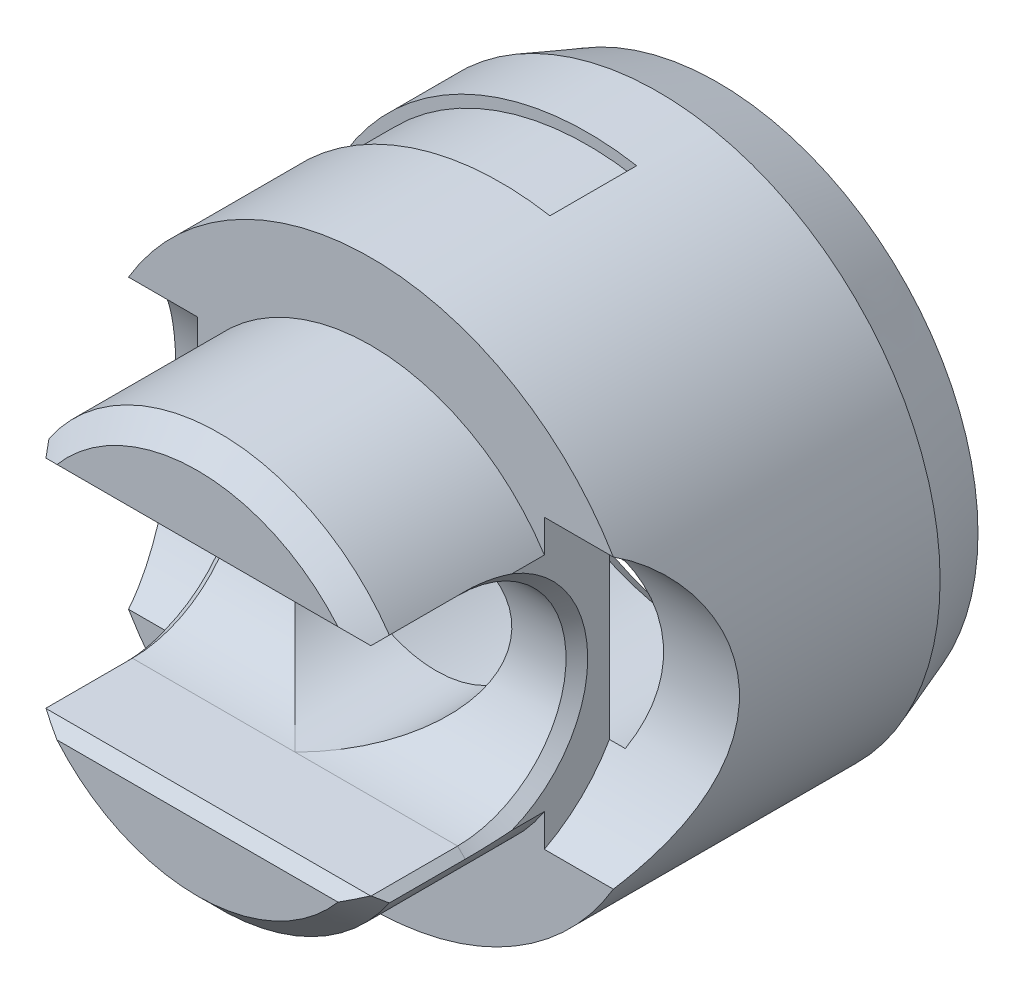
ISO-10303-21;
HEADER;
FILE_DESCRIPTION(('STEP AP214'),'2;1');
FILE_NAME('part.step','',(''),(''),'','','');
FILE_SCHEMA(('AUTOMOTIVE_DESIGN { 1 0 10303 214 1 1 1 1 }'));
ENDSEC;
DATA;
#1=APPLICATION_CONTEXT('core data for automotive mechanical design processes');
#2=APPLICATION_PROTOCOL_DEFINITION('international standard','automotive_design',2000,#1);
#3=PRODUCT_CONTEXT('',#1,'mechanical');
#4=PRODUCT('Part','Part','',(#3));
#5=PRODUCT_RELATED_PRODUCT_CATEGORY('part','',(#4));
#6=PRODUCT_DEFINITION_FORMATION('','',#4);
#7=PRODUCT_DEFINITION_CONTEXT('part definition',#1,'design');
#8=PRODUCT_DEFINITION('design','',#6,#7);
#9=PRODUCT_DEFINITION_SHAPE('','',#8);
#10=(LENGTH_UNIT() NAMED_UNIT(*) SI_UNIT(.MILLI.,.METRE.));
#11=(NAMED_UNIT(*) PLANE_ANGLE_UNIT() SI_UNIT($,.RADIAN.));
#12=(NAMED_UNIT(*) SI_UNIT($,.STERADIAN.) SOLID_ANGLE_UNIT());
#13=UNCERTAINTY_MEASURE_WITH_UNIT(LENGTH_MEASURE(1.E-05),#10,'distance_accuracy_value','');
#14=(GEOMETRIC_REPRESENTATION_CONTEXT(3) GLOBAL_UNCERTAINTY_ASSIGNED_CONTEXT((#13)) GLOBAL_UNIT_ASSIGNED_CONTEXT((#10,
#11,#12)) REPRESENTATION_CONTEXT('',''));
#15=CARTESIAN_POINT('',(0.,0.,0.));
#16=DIRECTION('',(0.,0.,1.));
#17=DIRECTION('',(1.,0.,0.));
#18=AXIS2_PLACEMENT_3D('',#15,#16,#17);
#19=CARTESIAN_POINT('',(0.,0.,24.));
#20=DIRECTION('',(0.,0.,-1.));
#21=DIRECTION('',(-1.,0.,0.));
#22=AXIS2_PLACEMENT_3D('',#19,#20,#21);
#23=CYLINDRICAL_SURFACE('',#22,13.);
#24=CARTESIAN_POINT('',(-11.180339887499,6.6332495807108,16.));
#25=CARTESIAN_POINT('',(-11.2412200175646,6.53064999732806,15.805576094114));
#26=CARTESIAN_POINT('',(-11.3049961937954,6.41992659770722,15.6164183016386));
#27=CARTESIAN_POINT('',(-11.4362532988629,6.18307191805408,15.2494297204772));
#28=CARTESIAN_POINT('',(-11.5037333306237,6.05694435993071,15.0715962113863));
#29=CARTESIAN_POINT('',(-11.6405738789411,5.78961818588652,14.7273736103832));
#30=CARTESIAN_POINT('',(-11.7099399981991,5.64836989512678,14.5610253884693));
#31=CARTESIAN_POINT('',(-11.8483936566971,5.3518535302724,14.2411765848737));
#32=CARTESIAN_POINT('',(-11.917481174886,5.19658441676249,14.0876769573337));
#33=CARTESIAN_POINT('',(-12.0535337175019,4.87269783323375,13.7943396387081));
#34=CARTESIAN_POINT('',(-12.1204982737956,4.70407744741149,13.6545049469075));
#35=CARTESIAN_POINT('',(-12.2505107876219,4.35428428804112,13.3894889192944));
#36=CARTESIAN_POINT('',(-12.3135591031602,4.17311266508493,13.2643062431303));
#37=CARTESIAN_POINT('',(-12.4339745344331,3.79931349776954,13.0297730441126));
#38=CARTESIAN_POINT('',(-12.4913483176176,3.60669983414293,12.9204038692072));
#39=CARTESIAN_POINT('',(-12.5988878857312,3.21092785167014,12.718460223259));
#40=CARTESIAN_POINT('',(-12.649054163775,3.00777025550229,12.6258846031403));
#41=CARTESIAN_POINT('',(-12.7385568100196,2.60198083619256,12.4625805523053));
#42=CARTESIAN_POINT('',(-12.7782889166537,2.3997656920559,12.391035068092));
#43=CARTESIAN_POINT('',(-12.8487137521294,1.98848386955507,12.2652113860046));
#44=CARTESIAN_POINT('',(-12.8794066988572,1.77941735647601,12.2109327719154));
#45=CARTESIAN_POINT('',(-12.930805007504,1.35633960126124,12.1204944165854));
#46=CARTESIAN_POINT('',(-12.951517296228,1.14233189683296,12.084322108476));
#47=CARTESIAN_POINT('',(-12.9823268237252,0.71124010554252,12.0306427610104));
#48=CARTESIAN_POINT('',(-12.99242546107,0.494156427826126,12.0131332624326));
#49=CARTESIAN_POINT('',(-13.0010962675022,0.0868702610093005,11.9980984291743));
#50=CARTESIAN_POINT('',(-13.0009756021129,-0.103225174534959,11.9983067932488));
#51=CARTESIAN_POINT('',(-12.992422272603,-0.482664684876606,12.0131398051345));
#52=CARTESIAN_POINT('',(-12.9839898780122,-0.672008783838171,12.0277639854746));
#53=CARTESIAN_POINT('',(-12.9590233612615,-1.04847489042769,12.071231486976));
#54=CARTESIAN_POINT('',(-12.9424907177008,-1.23559729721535,12.1000722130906));
#55=CARTESIAN_POINT('',(-12.9017257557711,-1.60631664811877,12.1716038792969));
#56=CARTESIAN_POINT('',(-12.8774932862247,-1.78991352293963,12.2142950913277));
#57=CARTESIAN_POINT('',(-12.8226429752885,-2.14747407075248,12.3116935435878));
#58=CARTESIAN_POINT('',(-12.7922152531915,-2.32156399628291,12.3660451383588));
#59=CARTESIAN_POINT('',(-12.7252505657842,-2.66430987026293,12.4868328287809));
#60=CARTESIAN_POINT('',(-12.6887116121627,-2.8329640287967,12.5532728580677));
#61=CARTESIAN_POINT('',(-12.5709978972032,-3.32947825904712,12.7698594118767));
#62=CARTESIAN_POINT('',(-12.4817003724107,-3.64805237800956,12.9373171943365));
#63=CARTESIAN_POINT('',(-12.2788082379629,-4.28404749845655,13.3314993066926));
#64=CARTESIAN_POINT('',(-12.1636983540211,-4.59837126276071,13.5623917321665));
#65=CARTESIAN_POINT('',(-11.9250766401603,-5.18584660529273,14.0679521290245));
#66=CARTESIAN_POINT('',(-11.8015655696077,-5.45900189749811,14.342616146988));
#67=CARTESIAN_POINT('',(-11.5921759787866,-5.8873342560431,14.8454903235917));
#68=CARTESIAN_POINT('',(-11.5057872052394,-6.05373369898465,15.0640201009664));
#69=CARTESIAN_POINT('',(-11.3800615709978,-6.28505277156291,15.4052525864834));
#70=CARTESIAN_POINT('',(-11.3388233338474,-6.35906723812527,15.5211509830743));
#71=CARTESIAN_POINT('',(-11.2581187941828,-6.50087858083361,15.7573340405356));
#72=CARTESIAN_POINT('',(-11.2186529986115,-6.56867368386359,15.8776199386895));
#73=CARTESIAN_POINT('',(-11.180339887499,-6.6332495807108,16.));
#74=B_SPLINE_CURVE_WITH_KNOTS('',3,(#24,#25,#26,#27,#28,#29,#30,#31,#32,#33,#34,#35,#36,#37,#38,
#39,#40,#41,#42,#43,#44,#45,#46,#47,#48,#49,#50,#51,#52,#53,#54,#55,#56,#57,#58,#59,#60,#61,#62,
#63,#64,#65,#66,#67,#68,#69,#70,#71,#72,#73),.UNSPECIFIED.,.F.,.F.,(4,2,2,2,2,2,2,2,2,2,2,2,2,2,
2,2,2,2,2,2,2,2,2,2,4),(0.,0.684017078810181,1.36786921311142,2.05404121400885,2.74026412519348,
3.42663731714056,4.11294767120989,4.79844179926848,5.48388900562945,6.13739395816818,
6.79088315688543,7.44391816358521,8.09686710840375,8.66644053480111,9.23599549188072,
9.80544652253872,10.3749087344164,10.9289918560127,11.4832556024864,12.5912775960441,
13.8065649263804,15.0217425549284,15.8839512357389,16.314456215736,16.7450835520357),.UNSPECIFIED.);
#75=CARTESIAN_POINT('',(-11.180339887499,6.6332495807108,16.));
#76=VERTEX_POINT('',#75);
#77=CARTESIAN_POINT('',(-11.1803398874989,-6.6332495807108,16.));
#78=VERTEX_POINT('',#77);
#79=EDGE_CURVE('E303',#76,#78,#74,.T.);
#80=ORIENTED_EDGE('',*,*,#79,.F.);
#81=CARTESIAN_POINT('',(0.,0.,16.));
#82=DIRECTION('',(0.,0.,1.));
#83=DIRECTION('',(1.,0.,0.));
#84=AXIS2_PLACEMENT_3D('',#81,#82,#83);
#85=CIRCLE('',#84,13.);
#86=CARTESIAN_POINT('',(11.180339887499,6.6332495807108,16.));
#87=VERTEX_POINT('',#86);
#88=EDGE_CURVE('E594',#87,#76,#85,.T.);
#89=ORIENTED_EDGE('',*,*,#88,.F.);
#90=CARTESIAN_POINT('',(11.180339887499,6.6332495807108,16.));
#91=CARTESIAN_POINT('',(11.2412167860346,6.53065544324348,15.8055864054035));
#92=CARTESIAN_POINT('',(11.3049894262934,6.41993834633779,15.6164383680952));
#93=CARTESIAN_POINT('',(11.4362398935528,6.18309656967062,15.2494660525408));
#94=CARTESIAN_POINT('',(11.5037168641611,6.05697544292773,15.0716391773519));
#95=CARTESIAN_POINT('',(11.640557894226,5.78965050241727,14.7274122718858));
#96=CARTESIAN_POINT('',(11.7099277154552,5.64839560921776,14.5610542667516));
#97=CARTESIAN_POINT('',(11.8483879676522,5.35186630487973,14.241189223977));
#98=CARTESIAN_POINT('',(11.9174783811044,5.19659102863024,14.0876829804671));
#99=CARTESIAN_POINT('',(12.0535379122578,4.87268788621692,13.7943305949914));
#100=CARTESIAN_POINT('',(12.1205065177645,4.70405682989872,13.6544877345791));
#101=CARTESIAN_POINT('',(12.2505280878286,4.35423618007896,13.3894540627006));
#102=CARTESIAN_POINT('',(12.3135813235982,4.17304745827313,13.2642622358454));
#103=CARTESIAN_POINT('',(12.4340005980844,3.79922882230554,13.029723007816));
#104=CARTESIAN_POINT('',(12.4913737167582,3.60661364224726,12.920355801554));
#105=CARTESIAN_POINT('',(12.5989040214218,3.21086118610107,12.718430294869));
#106=CARTESIAN_POINT('',(12.6490629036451,3.00772639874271,12.6258680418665));
#107=CARTESIAN_POINT('',(12.7327882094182,2.62813816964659,12.4731062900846));
#108=CARTESIAN_POINT('',(12.7677244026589,2.45311990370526,12.4100785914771));
#109=CARTESIAN_POINT('',(12.8308931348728,2.09778991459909,12.2969434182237));
#110=CARTESIAN_POINT('',(12.8591268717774,1.91747914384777,12.2468336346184));
#111=CARTESIAN_POINT('',(12.9082041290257,1.553061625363,12.1601767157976));
#112=CARTESIAN_POINT('',(12.9290635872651,1.36896398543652,12.123600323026));
#113=CARTESIAN_POINT('',(12.9629797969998,0.997909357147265,12.0643130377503));
#114=CARTESIAN_POINT('',(12.9760406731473,0.810953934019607,12.041594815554));
#115=CARTESIAN_POINT('',(12.9900224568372,0.519696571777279,12.0173048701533));
#116=CARTESIAN_POINT('',(12.993760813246,0.415910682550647,12.0108189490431));
#117=CARTESIAN_POINT('',(12.998750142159,0.208087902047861,12.0021658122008));
#118=CARTESIAN_POINT('',(13.000000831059,0.104050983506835,11.9999990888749));
#119=CARTESIAN_POINT('',(12.9999984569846,-0.193189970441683,12.000001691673));
#120=CARTESIAN_POINT('',(12.9956825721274,-0.3864284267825,12.007475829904));
#121=CARTESIAN_POINT('',(12.9785219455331,-0.771457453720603,12.0372809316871));
#122=CARTESIAN_POINT('',(12.9656722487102,-0.963247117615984,12.0596205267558));
#123=CARTESIAN_POINT('',(12.9317375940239,-1.34416780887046,12.1189140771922));
#124=CARTESIAN_POINT('',(12.9106379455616,-1.53329346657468,12.1558941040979));
#125=CARTESIAN_POINT('',(12.860715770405,-1.9072483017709,12.2440143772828));
#126=CARTESIAN_POINT('',(12.8318899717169,-2.09207562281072,12.2951606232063));
#127=CARTESIAN_POINT('',(12.7673788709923,-2.45516922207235,12.4106949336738));
#128=CARTESIAN_POINT('',(12.7317314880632,-2.63346556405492,12.4750099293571));
#129=CARTESIAN_POINT('',(12.6542605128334,-2.98359862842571,12.6164103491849));
#130=CARTESIAN_POINT('',(12.6124345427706,-3.15543283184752,12.6935006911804));
#131=CARTESIAN_POINT('',(12.5235109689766,-3.49169010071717,12.8597243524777));
#132=CARTESIAN_POINT('',(12.4764147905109,-3.65611515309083,12.9488544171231));
#133=CARTESIAN_POINT('',(12.3778914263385,-3.9769355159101,13.1384952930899));
#134=CARTESIAN_POINT('',(12.3264626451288,-4.13332783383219,13.2390103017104));
#135=CARTESIAN_POINT('',(12.1593553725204,-4.61187270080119,13.5722036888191));
#136=CARTESIAN_POINT('',(12.0375784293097,-4.91863176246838,13.8243525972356));
#137=CARTESIAN_POINT('',(11.7891702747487,-5.48742637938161,14.3722241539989));
#138=CARTESIAN_POINT('',(11.662542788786,-5.74949544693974,14.6679138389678));
#139=CARTESIAN_POINT('',(11.4766000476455,-6.10787949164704,15.142940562));
#140=CARTESIAN_POINT('',(11.4148310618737,-6.22228880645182,15.3079109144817));
#141=CARTESIAN_POINT('',(11.2946799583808,-6.4378102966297,15.6470974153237));
#142=CARTESIAN_POINT('',(11.2362928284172,-6.53894244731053,15.8212991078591));
#143=CARTESIAN_POINT('',(11.180339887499,-6.6332495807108,16.));
#144=B_SPLINE_CURVE_WITH_KNOTS('',3,(#90,#91,#92,#93,#94,#95,#96,#97,#98,#99,#100,#101,#102,
#103,#104,#105,#106,#107,#108,#109,#110,#111,#112,#113,#114,#115,#116,#117,#118,#119,#120,#121,
#122,#123,#124,#125,#126,#127,#128,#129,#130,#131,#132,#133,#134,#135,#136,#137,#138,#139,#140,
#141,#142,#143),.UNSPECIFIED.,.F.,.F.,(4,2,2,2,2,2,2,2,2,2,2,2,2,2,2,2,2,2,2,2,2,2,2,2,2,2,4),
(0.,0.683980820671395,1.36780417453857,2.05401296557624,2.74026412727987,3.42667970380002,
4.11304768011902,4.79854907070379,5.48388901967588,6.05111562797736,6.61824077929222,
7.18413260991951,7.74972487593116,8.06178452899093,8.37387975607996,8.95334249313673,
9.53314198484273,10.1139786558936,10.6950616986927,11.2730038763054,11.8511690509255,
12.4291782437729,13.0074012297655,14.248154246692,15.4879727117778,16.1175424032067,
16.7461537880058),.UNSPECIFIED.);
#145=CARTESIAN_POINT('',(11.1803398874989,-6.6332495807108,16.));
#146=VERTEX_POINT('',#145);
#147=EDGE_CURVE('E617',#87,#146,#144,.T.);
#148=ORIENTED_EDGE('',*,*,#147,.T.);
#149=EDGE_CURVE('E592',#78,#146,#85,.T.);
#150=ORIENTED_EDGE('',*,*,#149,.F.);
#151=EDGE_LOOP('',(#80,#89,#148,#150));
#152=FACE_BOUND('',#151,.T.);
#153=CARTESIAN_POINT('',(0.,0.,2.7474774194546));
#154=DIRECTION('',(0.,0.,1.));
#155=DIRECTION('',(1.,0.,0.));
#156=AXIS2_PLACEMENT_3D('',#153,#154,#155);
#157=CIRCLE('',#156,13.);
#158=CARTESIAN_POINT('',(13.,0.,2.7474774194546));
#159=VERTEX_POINT('',#158);
#160=EDGE_CURVE('E471',#159,#159,#157,.T.);
#161=ORIENTED_EDGE('',*,*,#160,.T.);
#162=EDGE_LOOP('',(#161));
#163=FACE_BOUND('',#162,.T.);
#164=DIRECTION('',(0.,0.,1.));
#165=VECTOR('',#164,1.);
#166=CARTESIAN_POINT('',(2.2574263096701,12.8025007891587,6.));
#167=LINE('',#166,#165);
#168=CARTESIAN_POINT('',(2.2574263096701,12.8025007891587,6.));
#169=VERTEX_POINT('',#168);
#170=CARTESIAN_POINT('',(2.2574263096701,12.8025007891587,10.));
#171=VERTEX_POINT('',#170);
#172=EDGE_CURVE('E248',#169,#171,#167,.T.);
#173=ORIENTED_EDGE('',*,*,#172,.T.);
#174=CARTESIAN_POINT('',(0.,0.,10.));
#175=DIRECTION('',(0.,0.,-1.));
#176=DIRECTION('',(-1.,0.,0.));
#177=AXIS2_PLACEMENT_3D('',#174,#175,#176);
#178=CIRCLE('',#177,13.);
#179=CARTESIAN_POINT('',(2.25742630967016,-12.8025007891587,10.));
#180=VERTEX_POINT('',#179);
#181=EDGE_CURVE('E234',#180,#171,#178,.T.);
#182=ORIENTED_EDGE('',*,*,#181,.F.);
#183=DIRECTION('',(0.,0.,1.));
#184=VECTOR('',#183,1.);
#185=CARTESIAN_POINT('',(2.25742630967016,-12.8025007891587,6.));
#186=LINE('',#185,#184);
#187=CARTESIAN_POINT('',(2.25742630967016,-12.8025007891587,6.));
#188=VERTEX_POINT('',#187);
#189=EDGE_CURVE('E252',#188,#180,#186,.T.);
#190=ORIENTED_EDGE('',*,*,#189,.F.);
#191=CARTESIAN_POINT('',(0.,0.,6.));
#192=DIRECTION('',(0.,0.,-1.));
#193=DIRECTION('',(-1.,0.,0.));
#194=AXIS2_PLACEMENT_3D('',#191,#192,#193);
#195=CIRCLE('',#194,13.);
#196=EDGE_CURVE('E263',#188,#169,#195,.T.);
#197=ORIENTED_EDGE('',*,*,#196,.T.);
#198=EDGE_LOOP('',(#173,#182,#190,#197));
#199=FACE_BOUND('',#198,.T.);
#200=ADVANCED_FACE('F32',(#152,#163,#199),#23,.T.);
#201=CARTESIAN_POINT('',(0.,0.,16.));
#202=DIRECTION('',(0.,0.,1.));
#203=DIRECTION('',(1.,0.,0.));
#204=AXIS2_PLACEMENT_3D('',#201,#202,#203);
#205=CYLINDRICAL_SURFACE('',#204,9.5);
#206=CARTESIAN_POINT('',(0.,0.,23.));
#207=DIRECTION('',(0.,0.,1.));
#208=DIRECTION('',(1.,0.,0.));
#209=AXIS2_PLACEMENT_3D('',#206,#207,#208);
#210=CIRCLE('',#209,9.5);
#211=CARTESIAN_POINT('',(7.85018939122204,-5.35018939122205,23.));
#212=VERTEX_POINT('',#211);
#213=CARTESIAN_POINT('',(-7.85018939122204,-5.35018939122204,23.));
#214=VERTEX_POINT('',#213);
#215=EDGE_CURVE('E590',#212,#214,#210,.F.);
#216=ORIENTED_EDGE('',*,*,#215,.T.);
#217=DIRECTION('',(0.,0.,1.));
#218=VECTOR('',#217,1.);
#219=CARTESIAN_POINT('',(-7.85018939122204,-5.35018939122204,16.));
#220=LINE('',#219,#218);
#221=CARTESIAN_POINT('',(-7.85018939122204,-5.35018939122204,19.5));
#222=VERTEX_POINT('',#221);
#223=EDGE_CURVE('E517',#214,#222,#220,.F.);
#224=ORIENTED_EDGE('',*,*,#223,.T.);
#225=CARTESIAN_POINT('',(-8.,-5.1234753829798,17.5));
#226=CARTESIAN_POINT('',(-7.98472394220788,-5.1473243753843,17.6031010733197));
#227=CARTESIAN_POINT('',(-7.97049590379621,-5.16930991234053,17.7067779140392));
#228=CARTESIAN_POINT('',(-7.94426231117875,-5.20953737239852,17.9151344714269));
#229=CARTESIAN_POINT('',(-7.93225676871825,-5.22777927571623,18.019814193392));
#230=CARTESIAN_POINT('',(-7.89992433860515,-5.27662159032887,18.3335749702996));
#231=CARTESIAN_POINT('',(-7.88305170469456,-5.30169222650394,18.5439105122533));
#232=CARTESIAN_POINT('',(-7.85928638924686,-5.33685990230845,18.9664464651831));
#233=CARTESIAN_POINT('',(-7.85239601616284,-5.34695347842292,19.1786472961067));
#234=CARTESIAN_POINT('',(-7.84975535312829,-5.35082524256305,19.4978700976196));
#235=CARTESIAN_POINT('',(-7.85017359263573,-5.35021433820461,19.6048282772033));
#236=CARTESIAN_POINT('',(-7.85360055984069,-5.34518080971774,19.8186144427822));
#237=CARTESIAN_POINT('',(-7.8566093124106,-5.34075814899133,19.9254424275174));
#238=CARTESIAN_POINT('',(-7.86090572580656,-5.33443166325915,20.0321174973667));
#239=B_SPLINE_CURVE_WITH_KNOTS('',3,(#225,#226,#227,#228,#229,#230,#231,#232,#233,#234,#235,
#236,#237,#238),.UNSPECIFIED.,.F.,.F.,(4,2,2,2,2,2,4),(0.,0.320716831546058,0.641435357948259,
1.27811814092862,1.91494813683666,2.23574302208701,2.55654098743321),.UNSPECIFIED.);
#240=CARTESIAN_POINT('',(-8.,-5.1234753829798,17.5));
#241=VERTEX_POINT('',#240);
#242=EDGE_CURVE('E533',#222,#241,#239,.F.);
#243=ORIENTED_EDGE('',*,*,#242,.T.);
#244=DIRECTION('',(0.,0.,1.));
#245=VECTOR('',#244,1.);
#246=CARTESIAN_POINT('',(-8.,-5.1234753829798,16.));
#247=LINE('',#246,#245);
#248=CARTESIAN_POINT('',(-8.,-5.1234753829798,16.));
#249=VERTEX_POINT('',#248);
#250=EDGE_CURVE('E283',#241,#249,#247,.F.);
#251=ORIENTED_EDGE('',*,*,#250,.T.);
#252=CARTESIAN_POINT('',(0.,0.,16.));
#253=DIRECTION('',(0.,0.,1.));
#254=DIRECTION('',(1.,0.,0.));
#255=AXIS2_PLACEMENT_3D('',#252,#253,#254);
#256=CIRCLE('',#255,9.5);
#257=CARTESIAN_POINT('',(8.,-5.1234753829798,16.));
#258=VERTEX_POINT('',#257);
#259=EDGE_CURVE('E585',#249,#258,#256,.T.);
#260=ORIENTED_EDGE('',*,*,#259,.T.);
#261=DIRECTION('',(0.,0.,1.));
#262=VECTOR('',#261,1.);
#263=CARTESIAN_POINT('',(8.,-5.1234753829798,16.));
#264=LINE('',#263,#262);
#265=CARTESIAN_POINT('',(8.,-5.1234753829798,17.5));
#266=VERTEX_POINT('',#265);
#267=EDGE_CURVE('E668',#258,#266,#264,.T.);
#268=ORIENTED_EDGE('',*,*,#267,.T.);
#269=CARTESIAN_POINT('',(8.,-5.1234753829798,17.5));
#270=CARTESIAN_POINT('',(7.98472394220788,-5.1473243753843,17.6031010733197));
#271=CARTESIAN_POINT('',(7.97049590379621,-5.16930991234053,17.7067779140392));
#272=CARTESIAN_POINT('',(7.94426231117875,-5.20953737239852,17.9151344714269));
#273=CARTESIAN_POINT('',(7.93225676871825,-5.22777927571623,18.019814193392));
#274=CARTESIAN_POINT('',(7.89992433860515,-5.27662159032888,18.3335749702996));
#275=CARTESIAN_POINT('',(7.88305170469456,-5.30169222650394,18.5439105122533));
#276=CARTESIAN_POINT('',(7.85928638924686,-5.33685990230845,18.966446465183));
#277=CARTESIAN_POINT('',(7.85239601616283,-5.34695347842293,19.1786472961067));
#278=CARTESIAN_POINT('',(7.84975535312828,-5.35082524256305,19.4978700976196));
#279=CARTESIAN_POINT('',(7.85017359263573,-5.35021433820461,19.6048282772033));
#280=CARTESIAN_POINT('',(7.85360055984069,-5.34518080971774,19.8186144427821));
#281=CARTESIAN_POINT('',(7.8566093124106,-5.34075814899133,19.9254424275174));
#282=CARTESIAN_POINT('',(7.86090572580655,-5.33443166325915,20.0321174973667));
#283=B_SPLINE_CURVE_WITH_KNOTS('',3,(#269,#270,#271,#272,#273,#274,#275,#276,#277,#278,#279,
#280,#281,#282),.UNSPECIFIED.,.F.,.F.,(4,2,2,2,2,2,4),(0.,0.320716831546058,0.641435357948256,
1.27811814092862,1.91494813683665,2.235743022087,2.55654098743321),.UNSPECIFIED.);
#284=CARTESIAN_POINT('',(7.85018939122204,-5.35018939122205,19.5));
#285=VERTEX_POINT('',#284);
#286=EDGE_CURVE('E505',#266,#285,#283,.T.);
#287=ORIENTED_EDGE('',*,*,#286,.T.);
#288=DIRECTION('',(0.,0.,1.));
#289=VECTOR('',#288,1.);
#290=CARTESIAN_POINT('',(7.85018939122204,-5.35018939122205,16.));
#291=LINE('',#290,#289);
#292=EDGE_CURVE('E537',#285,#212,#291,.T.);
#293=ORIENTED_EDGE('',*,*,#292,.T.);
#294=EDGE_LOOP('',(#216,#224,#243,#251,#260,#268,#287,#293));
#295=FACE_BOUND('',#294,.T.);
#296=ADVANCED_FACE('F364',(#295),#205,.T.);
#297=CARTESIAN_POINT('',(0.,0.,24.));
#298=DIRECTION('',(0.,0.,-1.));
#299=DIRECTION('',(-1.,0.,0.));
#300=AXIS2_PLACEMENT_3D('',#297,#298,#299);
#301=CONICAL_SURFACE('',#300,8.5,0.785398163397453);
#302=CARTESIAN_POINT('',(-20.3095583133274,-5.,11.5840214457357));
#303=CARTESIAN_POINT('',(-19.8147165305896,-5.,12.0644849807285));
#304=CARTESIAN_POINT('',(-19.3194020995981,-5.,12.5444634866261));
#305=CARTESIAN_POINT('',(-18.3275087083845,-5.,13.5031310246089));
#306=CARTESIAN_POINT('',(-17.8309297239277,-5.,13.9818200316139));
#307=CARTESIAN_POINT('',(-16.8357190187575,-5.,14.938039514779));
#308=CARTESIAN_POINT('',(-16.3370857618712,-5.,15.4155683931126));
#309=CARTESIAN_POINT('',(-15.3377987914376,-5.,16.3684970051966));
#310=CARTESIAN_POINT('',(-14.8371451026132,-5.,16.8438967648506));
#311=CARTESIAN_POINT('',(-13.8196995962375,-5.,17.8045838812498));
#312=CARTESIAN_POINT('',(-13.3028351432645,-5.,18.289794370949));
#313=CARTESIAN_POINT('',(-12.2652461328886,-5.,19.2561206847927));
#314=CARTESIAN_POINT('',(-11.7445214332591,-5.,19.7372363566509));
#315=CARTESIAN_POINT('',(-10.9594734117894,-5.,20.4543019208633));
#316=CARTESIAN_POINT('',(-10.6971990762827,-5.,20.6924946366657));
#317=CARTESIAN_POINT('',(-10.1709892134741,-5.,21.1670368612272));
#318=CARTESIAN_POINT('',(-9.90705369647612,-5.,21.4033863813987));
#319=CARTESIAN_POINT('',(-9.37716904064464,-5.,21.8737858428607));
#320=CARTESIAN_POINT('',(-9.11122002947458,-5.,22.1078359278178));
#321=CARTESIAN_POINT('',(-8.57681132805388,-5.,22.5730486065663));
#322=CARTESIAN_POINT('',(-8.30835168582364,-5.,22.8042112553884));
#323=CARTESIAN_POINT('',(-7.86040435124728,-5.,23.1845743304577));
#324=CARTESIAN_POINT('',(-7.68181235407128,-5.,23.3348292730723));
#325=CARTESIAN_POINT('',(-7.32301069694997,-5.,23.6334011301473));
#326=CARTESIAN_POINT('',(-7.1428010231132,-5.,23.7817180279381));
#327=CARTESIAN_POINT('',(-6.78038072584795,-5.,24.0760828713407));
#328=CARTESIAN_POINT('',(-6.59816911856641,-5.,24.222129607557));
#329=CARTESIAN_POINT('',(-6.23147662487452,-5.,24.5113461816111));
#330=CARTESIAN_POINT('',(-6.04699577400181,-5.,24.6545160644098));
#331=CARTESIAN_POINT('',(-5.67593660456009,-5.,24.9368128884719));
#332=CARTESIAN_POINT('',(-5.48936741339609,-5.,25.0759517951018));
#333=CARTESIAN_POINT('',(-5.1129568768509,-5.,25.3497804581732));
#334=CARTESIAN_POINT('',(-4.92311527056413,-5.,25.4844698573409));
#335=CARTESIAN_POINT('',(-4.53964585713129,-5.,25.7480376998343));
#336=CARTESIAN_POINT('',(-4.3460211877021,-5.,25.8769206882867));
#337=CARTESIAN_POINT('',(-3.95405279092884,-5.,26.1272635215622));
#338=CARTESIAN_POINT('',(-3.75571012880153,-5.,26.2487250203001));
#339=CARTESIAN_POINT('',(-3.39030675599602,-5.,26.4604394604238));
#340=CARTESIAN_POINT('',(-3.22419667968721,-5.,26.552325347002));
#341=CARTESIAN_POINT('',(-2.88761201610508,-5.,26.727853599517));
#342=CARTESIAN_POINT('',(-2.71713689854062,-5.,26.8114949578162));
#343=CARTESIAN_POINT('',(-2.37166987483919,-5.,26.9681684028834));
#344=CARTESIAN_POINT('',(-2.19668586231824,-5.,27.0412177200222));
#345=CARTESIAN_POINT('',(-1.84174808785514,-5.,27.1741196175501));
#346=CARTESIAN_POINT('',(-1.66179586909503,-5.,27.2339762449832));
#347=CARTESIAN_POINT('',(-1.33554208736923,-5.,27.32654665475));
#348=CARTESIAN_POINT('',(-1.19011361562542,-5.,27.3623209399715));
#349=CARTESIAN_POINT('',(-0.8968627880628,-5.,27.4222265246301));
#350=CARTESIAN_POINT('',(-0.749040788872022,-5.,27.4463595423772));
#351=CARTESIAN_POINT('',(-0.452209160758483,-5.,27.4817488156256));
#352=CARTESIAN_POINT('',(-0.303203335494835,-5.,27.4930365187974));
#353=CARTESIAN_POINT('',(-0.00477277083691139,-5.,27.502222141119));
#354=CARTESIAN_POINT('',(0.144651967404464,-5.,27.5001200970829));
#355=CARTESIAN_POINT('',(0.442553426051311,-5.,27.4826542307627));
#356=CARTESIAN_POINT('',(0.591030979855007,-5.,27.4673043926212));
#357=CARTESIAN_POINT('',(0.886154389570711,-5.,27.4241805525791));
#358=CARTESIAN_POINT('',(1.03280010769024,-5.,27.396405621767));
#359=CARTESIAN_POINT('',(1.32394461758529,-5.,27.3296347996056));
#360=CARTESIAN_POINT('',(1.46843564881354,-5.,27.2906054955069));
#361=CARTESIAN_POINT('',(1.75441679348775,-5.,27.2028832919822));
#362=CARTESIAN_POINT('',(1.89590690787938,-5.,27.1541903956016));
#363=CARTESIAN_POINT('',(2.21499696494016,-5.,27.0338623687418));
#364=CARTESIAN_POINT('',(2.39160938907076,-5.,26.9596214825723));
#365=CARTESIAN_POINT('',(2.74003775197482,-5.,26.8005474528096));
#366=CARTESIAN_POINT('',(2.91185118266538,-5.,26.7157088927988));
#367=CARTESIAN_POINT('',(3.25141021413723,-5.,26.5375557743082));
#368=CARTESIAN_POINT('',(3.41914743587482,-5.,26.4442253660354));
#369=CARTESIAN_POINT('',(3.75073990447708,-5.,26.2510078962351));
#370=CARTESIAN_POINT('',(3.91459577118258,-5.,26.1511218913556));
#371=CARTESIAN_POINT('',(4.2413966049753,-5.,25.9446071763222));
#372=CARTESIAN_POINT('',(4.40429204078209,-5.,25.8379004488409));
#373=CARTESIAN_POINT('',(4.72717294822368,-5.,25.6201774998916));
#374=CARTESIAN_POINT('',(4.88715832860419,-5.,25.5091611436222));
#375=CARTESIAN_POINT('',(5.20445797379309,-5.,25.2837730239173));
#376=CARTESIAN_POINT('',(5.36177515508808,-5.,25.1694053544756));
#377=CARTESIAN_POINT('',(5.6742862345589,-5.,24.9378228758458));
#378=CARTESIAN_POINT('',(5.82948020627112,-5.,24.820608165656));
#379=CARTESIAN_POINT('',(6.15373404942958,-5.,24.5717872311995));
#380=CARTESIAN_POINT('',(6.32260027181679,-5.,24.4399290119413));
#381=CARTESIAN_POINT('',(6.65846653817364,-5.,24.1738543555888));
#382=CARTESIAN_POINT('',(6.82546653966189,-5.,24.0396378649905));
#383=CARTESIAN_POINT('',(7.32412171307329,-5.,23.634043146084));
#384=CARTESIAN_POINT('',(7.65340087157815,-5.,23.3597438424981));
#385=CARTESIAN_POINT('',(8.30738709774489,-5.,22.8055341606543));
#386=CARTESIAN_POINT('',(8.63209242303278,-5.,22.5256217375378));
#387=CARTESIAN_POINT('',(9.27794418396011,-5.,21.961713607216));
#388=CARTESIAN_POINT('',(9.59909054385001,-5.,21.6777178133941));
#389=CARTESIAN_POINT('',(10.2392292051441,-5.,21.1060959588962));
#390=CARTESIAN_POINT('',(10.558216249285,-5.,20.8184640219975));
#391=CARTESIAN_POINT('',(11.1940067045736,-5.,20.2407923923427));
#392=CARTESIAN_POINT('',(11.5108100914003,-5.,19.9507526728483));
#393=CARTESIAN_POINT('',(12.142589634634,-5.,19.3688400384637));
#394=CARTESIAN_POINT('',(12.4575662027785,-5.,19.0769675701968));
#395=CARTESIAN_POINT('',(13.0860926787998,-5.,18.4916907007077));
#396=CARTESIAN_POINT('',(13.3996425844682,-5.,18.1982862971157));
#397=CARTESIAN_POINT('',(14.2683951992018,-5.,17.3821070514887));
#398=CARTESIAN_POINT('',(14.822339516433,-5.,16.8579930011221));
#399=CARTESIAN_POINT('',(15.9275881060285,-5.,15.8069169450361));
#400=CARTESIAN_POINT('',(16.4788921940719,-5.,15.2799547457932));
#401=CARTESIAN_POINT('',(17.5776480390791,-5.,14.2257086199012));
#402=CARTESIAN_POINT('',(18.1251065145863,-5.,13.6984316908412));
#403=CARTESIAN_POINT('',(19.2184175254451,-5.,12.6423030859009));
#404=CARTESIAN_POINT('',(19.7642701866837,-5.,12.1134515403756));
#405=CARTESIAN_POINT('',(20.3095583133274,-5.,11.5840214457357));
#406=B_SPLINE_CURVE_WITH_KNOTS('',3,(#302,#303,#304,#305,#306,#307,#308,#309,#310,#311,#312,
#313,#314,#315,#316,#317,#318,#319,#320,#321,#322,#323,#324,#325,#326,#327,#328,#329,#330,#331,
#332,#333,#334,#335,#336,#337,#338,#339,#340,#341,#342,#343,#344,#345,#346,#347,#348,#349,#350,
#351,#352,#353,#354,#355,#356,#357,#358,#359,#360,#361,#362,#363,#364,#365,#366,#367,#368,#369,
#370,#371,#372,#373,#374,#375,#376,#377,#378,#379,#380,#381,#382,#383,#384,#385,#386,#387,#388,
#389,#390,#391,#392,#393,#394,#395,#396,#397,#398,#399,#400,#401,#402,#403,#404,#405),
.UNSPECIFIED.,.F.,.F.,(4,2,2,2,2,2,2,2,2,2,2,2,2,2,2,2,2,2,2,2,2,2,2,2,2,2,2,2,2,2,2,2,2,2,2,2,
2,2,2,2,2,2,2,2,2,2,2,2,2,2,2,4),(0.,2.0691613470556,4.13836265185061,6.20959447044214,
8.28080102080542,10.4075694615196,12.5344166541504,13.5972893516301,14.6601554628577,
15.7229547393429,16.7857337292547,17.4858977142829,18.1860677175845,18.8865987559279,
19.5871188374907,20.2852857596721,20.9835086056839,21.6811750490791,22.3786854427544,
22.9479974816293,23.5173790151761,24.0858236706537,24.6540937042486,25.1029750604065,
25.5517901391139,25.9995040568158,26.4472167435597,26.8944574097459,27.3417315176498,
27.7903474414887,28.2389632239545,28.8132480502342,29.3878276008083,29.9635024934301,
30.5390848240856,31.1232016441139,31.7073367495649,32.290785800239,32.8742145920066,
33.5169337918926,34.1596675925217,35.4452535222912,36.7313166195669,38.0174070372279,
39.3059430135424,40.5944933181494,41.882740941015,43.1709905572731,45.4587574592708,
47.7466818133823,50.0269380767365,52.3070105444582),.UNSPECIFIED.);
#407=CARTESIAN_POINT('',(7.48331477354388,-5.,23.5000000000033));
#408=VERTEX_POINT('',#407);
#409=CARTESIAN_POINT('',(7.5,-5.,23.48612181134));
#410=VERTEX_POINT('',#409);
#411=EDGE_CURVE('E381',#408,#410,#406,.T.);
#412=ORIENTED_EDGE('',*,*,#411,.F.);
#413=CARTESIAN_POINT('',(7.4833147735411,-5.,23.5));
#414=CARTESIAN_POINT('',(7.40173164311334,-5.04360775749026,23.5436077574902));
#415=CARTESIAN_POINT('',(7.31966293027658,-5.08676246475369,23.5867624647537));
#416=CARTESIAN_POINT('',(7.1545650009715,-5.17210763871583,23.6721076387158));
#417=CARTESIAN_POINT('',(7.07153606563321,-5.21429837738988,23.7142983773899));
#418=CARTESIAN_POINT('',(6.9044799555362,-5.29768334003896,23.797683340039));
#419=CARTESIAN_POINT('',(6.82045275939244,-5.33887754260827,23.8388775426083));
#420=CARTESIAN_POINT('',(6.6513671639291,-5.42023081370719,23.9202308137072));
#421=CARTESIAN_POINT('',(6.56630847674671,-5.4603895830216,23.9603895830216));
#422=CARTESIAN_POINT('',(6.48074069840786,-5.50000000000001,24.));
#423=B_SPLINE_CURVE_WITH_KNOTS('',3,(#413,#414,#415,#416,#417,#418,#419,#420,#421,#422),
.UNSPECIFIED.,.F.,.F.,(4,2,2,2,4),(0.,0.306807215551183,0.61352677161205,0.920252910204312,
1.22706671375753),.UNSPECIFIED.);
#424=CARTESIAN_POINT('',(6.48074069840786,-5.50000000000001,24.));
#425=VERTEX_POINT('',#424);
#426=EDGE_CURVE('E409',#408,#425,#423,.T.);
#427=ORIENTED_EDGE('',*,*,#426,.T.);
#428=CARTESIAN_POINT('',(0.,0.,24.));
#429=DIRECTION('',(0.,0.,1.));
#430=DIRECTION('',(1.,0.,0.));
#431=AXIS2_PLACEMENT_3D('',#428,#429,#430);
#432=CIRCLE('',#431,8.5);
#433=CARTESIAN_POINT('',(-6.48074069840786,-5.50000000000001,24.));
#434=VERTEX_POINT('',#433);
#435=EDGE_CURVE('E558',#434,#425,#432,.T.);
#436=ORIENTED_EDGE('',*,*,#435,.F.);
#437=CARTESIAN_POINT('',(-6.48074069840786,-5.50000000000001,24.));
#438=CARTESIAN_POINT('',(-6.56630847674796,-5.46038958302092,23.9603895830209));
#439=CARTESIAN_POINT('',(-6.6513671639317,-5.42023081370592,23.9202308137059));
#440=CARTESIAN_POINT('',(-6.82045275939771,-5.33887754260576,23.8388775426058));
#441=CARTESIAN_POINT('',(-6.90447995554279,-5.29768334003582,23.7976833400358));
#442=CARTESIAN_POINT('',(-7.07153606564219,-5.21429837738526,23.7142983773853));
#443=CARTESIAN_POINT('',(-7.15456500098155,-5.17210763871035,23.6721076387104));
#444=CARTESIAN_POINT('',(-7.31966293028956,-5.08676246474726,23.5867624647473));
#445=CARTESIAN_POINT('',(-7.40173164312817,-5.04360775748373,23.5436077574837));
#446=CARTESIAN_POINT('',(-7.48331477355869,-4.99999999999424,23.4999999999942));
#447=B_SPLINE_CURVE_WITH_KNOTS('',3,(#437,#438,#439,#440,#441,#442,#443,#444,#445,#446),
.UNSPECIFIED.,.F.,.F.,(4,2,2,2,4),(0.,0.306813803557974,0.613539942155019,0.920259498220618,
1.22706671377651),.UNSPECIFIED.);
#448=CARTESIAN_POINT('',(-7.48331477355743,-5.,23.4999999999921));
#449=VERTEX_POINT('',#448);
#450=EDGE_CURVE('E403',#434,#449,#447,.T.);
#451=ORIENTED_EDGE('',*,*,#450,.T.);
#452=CARTESIAN_POINT('',(-7.50000000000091,-5.,23.4861218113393));
#453=VERTEX_POINT('',#452);
#454=EDGE_CURVE('E571',#453,#449,#406,.T.);
#455=ORIENTED_EDGE('',*,*,#454,.F.);
#456=CARTESIAN_POINT('',(-7.85018939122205,-5.35018939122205,23.));
#457=CARTESIAN_POINT('',(-7.61587138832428,-5.11587138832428,23.3255418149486));
#458=CARTESIAN_POINT('',(-7.38137178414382,-4.88137178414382,23.6508235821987));
#459=CARTESIAN_POINT('',(-6.91186536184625,-4.41186536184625,24.3003968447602));
#460=CARTESIAN_POINT('',(-6.67685877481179,-4.17685877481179,24.6246886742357));
#461=CARTESIAN_POINT('',(-6.20636459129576,-3.70636459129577,25.2715814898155));
#462=CARTESIAN_POINT('',(-5.97087823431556,-3.47087823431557,25.5941842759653));
#463=CARTESIAN_POINT('',(-5.61664754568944,-3.11664754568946,26.0767426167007));
#464=CARTESIAN_POINT('',(-5.49838182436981,-2.99838182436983,26.2374006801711));
#465=CARTESIAN_POINT('',(-5.26144035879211,-2.76144035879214,26.5581196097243));
#466=CARTESIAN_POINT('',(-5.14276460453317,-2.64276460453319,26.7181804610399));
#467=CARTESIAN_POINT('',(-4.90455654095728,-2.4045565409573,27.0379717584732));
#468=CARTESIAN_POINT('',(-4.78502276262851,-2.28502276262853,27.1977000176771));
#469=CARTESIAN_POINT('',(-4.54527295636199,-2.04527295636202,27.5161015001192));
#470=CARTESIAN_POINT('',(-4.42505698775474,-1.92505698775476,27.6747748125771));
#471=CARTESIAN_POINT('',(-4.18381041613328,-1.68381041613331,27.9905306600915));
#472=CARTESIAN_POINT('',(-4.06278076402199,-1.56278076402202,28.1476146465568));
#473=CARTESIAN_POINT('',(-3.81938081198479,-1.31938081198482,28.4598096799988));
#474=CARTESIAN_POINT('',(-3.69701010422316,-1.19701010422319,28.6149200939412));
#475=CARTESIAN_POINT('',(-3.51181635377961,-1.01181635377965,28.8455603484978));
#476=CARTESIAN_POINT('',(-3.44970471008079,-0.949704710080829,28.9222320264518));
#477=CARTESIAN_POINT('',(-3.32489070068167,-0.824890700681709,29.0746021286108));
#478=CARTESIAN_POINT('',(-3.26218835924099,-0.762188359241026,29.1503005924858));
#479=CARTESIAN_POINT('',(-3.13610493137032,-0.63610493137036,29.3003955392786));
#480=CARTESIAN_POINT('',(-3.07272451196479,-0.572724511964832,29.3747931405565));
#481=CARTESIAN_POINT('',(-2.94502703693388,-0.445027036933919,29.5219985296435));
#482=CARTESIAN_POINT('',(-2.88070983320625,-0.380709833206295,29.5948060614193));
#483=CARTESIAN_POINT('',(-2.75063102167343,-0.250631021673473,29.7385731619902));
#484=CARTESIAN_POINT('',(-2.68486465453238,-0.184864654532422,29.8095241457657));
#485=CARTESIAN_POINT('',(-2.55181087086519,-0.0518108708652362,29.948454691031));
#486=CARTESIAN_POINT('',(-2.48452415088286,0.015475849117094,30.0164355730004));
#487=CARTESIAN_POINT('',(-2.381967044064,0.118032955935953,30.1153714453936));
#488=CARTESIAN_POINT('',(-2.34745310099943,0.152546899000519,30.1478942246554));
#489=CARTESIAN_POINT('',(-2.2778423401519,0.222157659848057,30.2116573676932));
#490=CARTESIAN_POINT('',(-2.24274559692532,0.257254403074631,30.2428978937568));
#491=CARTESIAN_POINT('',(-2.17182936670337,0.328170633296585,30.3038791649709));
#492=CARTESIAN_POINT('',(-2.13600886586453,0.363991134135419,30.3336175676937));
#493=CARTESIAN_POINT('',(-2.06359117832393,0.436408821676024,30.3911887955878));
#494=CARTESIAN_POINT('',(-2.02699365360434,0.47300634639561,30.4190207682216));
#495=CARTESIAN_POINT('',(-1.98997069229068,0.510029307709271,30.4457085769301));
#496=B_SPLINE_CURVE_WITH_KNOTS('',3,(#456,#457,#458,#459,#460,#461,#462,#463,#464,#465,#466,
#467,#468,#469,#470,#471,#472,#473,#474,#475,#476,#477,#478,#479,#480,#481,#482,#483,#484,#485,
#486,#487,#488,#489,#490,#491,#492,#493,#494,#495),.UNSPECIFIED.,.F.,.F.,(4,2,2,2,2,2,2,2,2,2,2,
2,2,2,2,2,2,2,2,4),(0.,1.39358863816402,2.78663862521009,4.17761171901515,4.87335567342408,
5.56911671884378,6.26682980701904,6.96448311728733,7.66142817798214,8.35859142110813,
8.70836939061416,9.05813305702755,9.40757956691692,9.75708193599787,10.1079863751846,
10.4587331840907,10.6346758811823,10.8105962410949,10.9867829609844,11.1630479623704),.UNSPECIFIED.);
#497=EDGE_CURVE('E396',#453,#214,#496,.F.);
#498=ORIENTED_EDGE('',*,*,#497,.T.);
#499=ORIENTED_EDGE('',*,*,#215,.F.);
#500=CARTESIAN_POINT('',(7.85018939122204,-5.35018939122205,23.));
#501=CARTESIAN_POINT('',(7.61587138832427,-5.11587138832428,23.3255418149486));
#502=CARTESIAN_POINT('',(7.38137178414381,-4.88137178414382,23.6508235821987));
#503=CARTESIAN_POINT('',(6.91186536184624,-4.41186536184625,24.3003968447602));
#504=CARTESIAN_POINT('',(6.67685877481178,-4.17685877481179,24.6246886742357));
#505=CARTESIAN_POINT('',(6.20636459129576,-3.70636459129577,25.2715814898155));
#506=CARTESIAN_POINT('',(5.97087823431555,-3.47087823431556,25.5941842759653));
#507=CARTESIAN_POINT('',(5.61664754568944,-3.11664754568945,26.0767426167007));
#508=CARTESIAN_POINT('',(5.49838182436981,-2.99838182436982,26.2374006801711));
#509=CARTESIAN_POINT('',(5.26144035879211,-2.76144035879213,26.5581196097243));
#510=CARTESIAN_POINT('',(5.14276460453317,-2.64276460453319,26.7181804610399));
#511=CARTESIAN_POINT('',(4.90455654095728,-2.4045565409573,27.0379717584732));
#512=CARTESIAN_POINT('',(4.78502276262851,-2.28502276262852,27.1977000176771));
#513=CARTESIAN_POINT('',(4.545272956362,-2.04527295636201,27.5161015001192));
#514=CARTESIAN_POINT('',(4.42505698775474,-1.92505698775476,27.6747748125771));
#515=CARTESIAN_POINT('',(4.18381041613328,-1.6838104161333,27.9905306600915));
#516=CARTESIAN_POINT('',(4.062780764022,-1.56278076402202,28.1476146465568));
#517=CARTESIAN_POINT('',(3.8193808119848,-1.31938081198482,28.4598096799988));
#518=CARTESIAN_POINT('',(3.69701010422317,-1.19701010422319,28.6149200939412));
#519=CARTESIAN_POINT('',(3.51181635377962,-1.01181635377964,28.8455603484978));
#520=CARTESIAN_POINT('',(3.4497047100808,-0.949704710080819,28.9222320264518));
#521=CARTESIAN_POINT('',(3.32489070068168,-0.824890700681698,29.0746021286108));
#522=CARTESIAN_POINT('',(3.26218835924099,-0.762188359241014,29.1503005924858));
#523=CARTESIAN_POINT('',(3.13610493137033,-0.636104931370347,29.3003955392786));
#524=CARTESIAN_POINT('',(3.0727245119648,-0.572724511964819,29.3747931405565));
#525=CARTESIAN_POINT('',(2.94502703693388,-0.445027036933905,29.5219985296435));
#526=CARTESIAN_POINT('',(2.88070983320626,-0.380709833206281,29.5948060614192));
#527=CARTESIAN_POINT('',(2.75063102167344,-0.250631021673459,29.7385731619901));
#528=CARTESIAN_POINT('',(2.68486465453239,-0.184864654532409,29.8095241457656));
#529=CARTESIAN_POINT('',(2.5518108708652,-0.0518108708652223,29.948454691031));
#530=CARTESIAN_POINT('',(2.48452415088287,0.0154758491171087,30.0164355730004));
#531=CARTESIAN_POINT('',(2.38196704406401,0.118032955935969,30.1153714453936));
#532=CARTESIAN_POINT('',(2.34745310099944,0.152546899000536,30.1478942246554));
#533=CARTESIAN_POINT('',(2.2778423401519,0.222157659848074,30.2116573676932));
#534=CARTESIAN_POINT('',(2.24274559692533,0.257254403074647,30.2428978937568));
#535=CARTESIAN_POINT('',(2.17182936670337,0.328170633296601,30.3038791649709));
#536=CARTESIAN_POINT('',(2.13600886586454,0.363991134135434,30.3336175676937));
#537=CARTESIAN_POINT('',(2.06359117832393,0.43640882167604,30.3911887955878));
#538=CARTESIAN_POINT('',(2.02699365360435,0.473006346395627,30.4190207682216));
#539=CARTESIAN_POINT('',(1.98997069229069,0.510029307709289,30.4457085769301));
#540=B_SPLINE_CURVE_WITH_KNOTS('',3,(#500,#501,#502,#503,#504,#505,#506,#507,#508,#509,#510,
#511,#512,#513,#514,#515,#516,#517,#518,#519,#520,#521,#522,#523,#524,#525,#526,#527,#528,#529,
#530,#531,#532,#533,#534,#535,#536,#537,#538,#539),.UNSPECIFIED.,.F.,.F.,(4,2,2,2,2,2,2,2,2,2,2,
2,2,2,2,2,2,2,2,4),(0.,1.39358863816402,2.78663862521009,4.17761171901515,4.87335567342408,
5.56911671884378,6.26682980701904,6.96448311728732,7.66142817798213,8.35859142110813,
8.70836939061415,9.05813305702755,9.40757956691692,9.75708193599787,10.1079863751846,
10.4587331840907,10.6346758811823,10.8105962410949,10.9867829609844,11.1630479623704),.UNSPECIFIED.);
#541=EDGE_CURVE('E388',#212,#410,#540,.T.);
#542=ORIENTED_EDGE('',*,*,#541,.T.);
#543=EDGE_LOOP('',(#412,#427,#436,#451,#455,#498,#499,#542));
#544=FACE_BOUND('',#543,.T.);
#545=ADVANCED_FACE('F359',(#544),#301,.T.);
#546=CARTESIAN_POINT('',(-8.,5.1234753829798,17.5));
#547=CARTESIAN_POINT('',(-7.98472394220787,5.1473243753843,17.6031010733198));
#548=CARTESIAN_POINT('',(-7.97049590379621,5.16930991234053,17.7067779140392));
#549=CARTESIAN_POINT('',(-7.94426231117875,5.20953737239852,17.9151344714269));
#550=CARTESIAN_POINT('',(-7.93225676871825,5.22777927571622,18.019814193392));
#551=CARTESIAN_POINT('',(-7.89992433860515,5.27662159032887,18.3335749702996));
#552=CARTESIAN_POINT('',(-7.88305170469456,5.30169222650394,18.5439105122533));
#553=CARTESIAN_POINT('',(-7.85928638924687,5.33685990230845,18.9664464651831));
#554=CARTESIAN_POINT('',(-7.85239601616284,5.34695347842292,19.1786472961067));
#555=CARTESIAN_POINT('',(-7.84975535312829,5.35082524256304,19.4978700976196));
#556=CARTESIAN_POINT('',(-7.85017359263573,5.35021433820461,19.6048282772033));
#557=CARTESIAN_POINT('',(-7.85360055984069,5.34518080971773,19.8186144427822));
#558=CARTESIAN_POINT('',(-7.85660931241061,5.34075814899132,19.9254424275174));
#559=CARTESIAN_POINT('',(-7.86090572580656,5.33443166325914,20.0321174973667));
#560=B_SPLINE_CURVE_WITH_KNOTS('',3,(#546,#547,#548,#549,#550,#551,#552,#553,#554,#555,#556,
#557,#558,#559),.UNSPECIFIED.,.F.,.F.,(4,2,2,2,2,2,4),(0.,0.320716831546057,0.641435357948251,
1.27811814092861,1.91494813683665,2.235743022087,2.5565409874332),.UNSPECIFIED.);
#561=CARTESIAN_POINT('',(-8.,5.1234753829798,17.5));
#562=VERTEX_POINT('',#561);
#563=CARTESIAN_POINT('',(-7.85018939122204,5.35018939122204,19.5));
#564=VERTEX_POINT('',#563);
#565=EDGE_CURVE('E47',#562,#564,#560,.T.);
#566=ORIENTED_EDGE('',*,*,#565,.T.);
#567=DIRECTION('',(0.,0.,1.));
#568=VECTOR('',#567,1.);
#569=CARTESIAN_POINT('',(-7.85018939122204,5.35018939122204,16.));
#570=LINE('',#569,#568);
#571=CARTESIAN_POINT('',(-7.85018939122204,5.35018939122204,23.));
#572=VERTEX_POINT('',#571);
#573=EDGE_CURVE('E524',#564,#572,#570,.T.);
#574=ORIENTED_EDGE('',*,*,#573,.T.);
#575=CARTESIAN_POINT('',(7.85018939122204,5.35018939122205,23.));
#576=VERTEX_POINT('',#575);
#577=EDGE_CURVE('E557',#572,#576,#210,.F.);
#578=ORIENTED_EDGE('',*,*,#577,.T.);
#579=DIRECTION('',(0.,0.,1.));
#580=VECTOR('',#579,1.);
#581=CARTESIAN_POINT('',(7.85018939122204,5.35018939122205,16.));
#582=LINE('',#581,#580);
#583=CARTESIAN_POINT('',(7.85018939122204,5.35018939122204,19.5));
#584=VERTEX_POINT('',#583);
#585=EDGE_CURVE('E54',#576,#584,#582,.F.);
#586=ORIENTED_EDGE('',*,*,#585,.T.);
#587=CARTESIAN_POINT('',(8.,5.1234753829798,17.5));
#588=CARTESIAN_POINT('',(7.98472394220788,5.1473243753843,17.6031010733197));
#589=CARTESIAN_POINT('',(7.97049590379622,5.16930991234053,17.7067779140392));
#590=CARTESIAN_POINT('',(7.94426231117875,5.20953737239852,17.9151344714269));
#591=CARTESIAN_POINT('',(7.93225676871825,5.22777927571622,18.019814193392));
#592=CARTESIAN_POINT('',(7.89992433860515,5.27662159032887,18.3335749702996));
#593=CARTESIAN_POINT('',(7.88305170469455,5.30169222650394,18.5439105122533));
#594=CARTESIAN_POINT('',(7.85928638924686,5.33685990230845,18.9664464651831));
#595=CARTESIAN_POINT('',(7.85239601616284,5.34695347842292,19.1786472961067));
#596=CARTESIAN_POINT('',(7.84975535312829,5.35082524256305,19.4978700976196));
#597=CARTESIAN_POINT('',(7.85017359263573,5.35021433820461,19.6048282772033));
#598=CARTESIAN_POINT('',(7.85360055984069,5.34518080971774,19.8186144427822));
#599=CARTESIAN_POINT('',(7.8566093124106,5.34075814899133,19.9254424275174));
#600=CARTESIAN_POINT('',(7.86090572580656,5.33443166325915,20.0321174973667));
#601=B_SPLINE_CURVE_WITH_KNOTS('',3,(#587,#588,#589,#590,#591,#592,#593,#594,#595,#596,#597,
#598,#599,#600),.UNSPECIFIED.,.F.,.F.,(4,2,2,2,2,2,4),(0.,0.320716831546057,0.641435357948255,
1.27811814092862,1.91494813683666,2.23574302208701,2.55654098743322),.UNSPECIFIED.);
#602=CARTESIAN_POINT('',(8.,5.1234753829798,17.5));
#603=VERTEX_POINT('',#602);
#604=EDGE_CURVE('E511',#584,#603,#601,.F.);
#605=ORIENTED_EDGE('',*,*,#604,.T.);
#606=DIRECTION('',(0.,0.,1.));
#607=VECTOR('',#606,1.);
#608=CARTESIAN_POINT('',(8.,5.1234753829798,16.));
#609=LINE('',#608,#607);
#610=CARTESIAN_POINT('',(8.,5.1234753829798,16.));
#611=VERTEX_POINT('',#610);
#612=EDGE_CURVE('E673',#603,#611,#609,.F.);
#613=ORIENTED_EDGE('',*,*,#612,.T.);
#614=CARTESIAN_POINT('',(-8.,5.1234753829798,16.));
#615=VERTEX_POINT('',#614);
#616=EDGE_CURVE('E595',#611,#615,#256,.T.);
#617=ORIENTED_EDGE('',*,*,#616,.T.);
#618=DIRECTION('',(0.,0.,1.));
#619=VECTOR('',#618,1.);
#620=CARTESIAN_POINT('',(-8.,5.1234753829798,16.));
#621=LINE('',#620,#619);
#622=EDGE_CURVE('E281',#615,#562,#621,.T.);
#623=ORIENTED_EDGE('',*,*,#622,.T.);
#624=EDGE_LOOP('',(#566,#574,#578,#586,#605,#613,#617,#623));
#625=FACE_BOUND('',#624,.T.);
#626=ADVANCED_FACE('F363',(#625),#205,.T.);
#627=CARTESIAN_POINT('',(20.3095583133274,5.,11.5840214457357));
#628=CARTESIAN_POINT('',(19.8147165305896,5.,12.0644849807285));
#629=CARTESIAN_POINT('',(19.3194020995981,5.,12.5444634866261));
#630=CARTESIAN_POINT('',(18.3275087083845,5.,13.5031310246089));
#631=CARTESIAN_POINT('',(17.8309297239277,5.,13.9818200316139));
#632=CARTESIAN_POINT('',(16.8357190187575,5.,14.9380395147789));
#633=CARTESIAN_POINT('',(16.3370857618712,5.,15.4155683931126));
#634=CARTESIAN_POINT('',(15.3377987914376,5.,16.3684970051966));
#635=CARTESIAN_POINT('',(14.8371451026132,5.,16.8438967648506));
#636=CARTESIAN_POINT('',(13.8196995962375,5.,17.8045838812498));
#637=CARTESIAN_POINT('',(13.3028351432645,5.,18.289794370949));
#638=CARTESIAN_POINT('',(12.2652461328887,5.,19.2561206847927));
#639=CARTESIAN_POINT('',(11.7445214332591,5.,19.7372363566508));
#640=CARTESIAN_POINT('',(10.9594734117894,5.,20.4543019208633));
#641=CARTESIAN_POINT('',(10.6971990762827,5.,20.6924946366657));
#642=CARTESIAN_POINT('',(10.1709892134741,5.,21.1670368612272));
#643=CARTESIAN_POINT('',(9.90705369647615,5.,21.4033863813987));
#644=CARTESIAN_POINT('',(9.37716904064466,5.,21.8737858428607));
#645=CARTESIAN_POINT('',(9.11122002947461,5.,22.1078359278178));
#646=CARTESIAN_POINT('',(8.5768113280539,5.,22.5730486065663));
#647=CARTESIAN_POINT('',(8.30835168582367,5.,22.8042112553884));
#648=CARTESIAN_POINT('',(7.86040435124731,5.,23.1845743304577));
#649=CARTESIAN_POINT('',(7.68181235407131,5.,23.3348292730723));
#650=CARTESIAN_POINT('',(7.32301069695,5.,23.6334011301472));
#651=CARTESIAN_POINT('',(7.14280102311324,5.,23.781718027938));
#652=CARTESIAN_POINT('',(6.78038072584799,5.,24.0760828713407));
#653=CARTESIAN_POINT('',(6.59816911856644,5.,24.222129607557));
#654=CARTESIAN_POINT('',(6.23147662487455,5.,24.511346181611));
#655=CARTESIAN_POINT('',(6.04699577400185,5.,24.6545160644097));
#656=CARTESIAN_POINT('',(5.67593660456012,5.,24.9368128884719));
#657=CARTESIAN_POINT('',(5.48936741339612,5.,25.0759517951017));
#658=CARTESIAN_POINT('',(5.11295687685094,5.,25.3497804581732));
#659=CARTESIAN_POINT('',(4.92311527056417,5.,25.4844698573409));
#660=CARTESIAN_POINT('',(4.53964585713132,5.,25.7480376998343));
#661=CARTESIAN_POINT('',(4.34602118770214,5.,25.8769206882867));
#662=CARTESIAN_POINT('',(3.95405279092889,5.,26.1272635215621));
#663=CARTESIAN_POINT('',(3.75571012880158,5.,26.2487250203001));
#664=CARTESIAN_POINT('',(3.39030675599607,5.,26.4604394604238));
#665=CARTESIAN_POINT('',(3.22419667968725,5.,26.552325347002));
#666=CARTESIAN_POINT('',(2.88761201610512,5.,26.727853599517));
#667=CARTESIAN_POINT('',(2.71713689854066,5.,26.8114949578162));
#668=CARTESIAN_POINT('',(2.37166987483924,5.,26.9681684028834));
#669=CARTESIAN_POINT('',(2.19668586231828,5.,27.0412177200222));
#670=CARTESIAN_POINT('',(1.84174808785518,5.,27.1741196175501));
#671=CARTESIAN_POINT('',(1.66179586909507,5.,27.2339762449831));
#672=CARTESIAN_POINT('',(1.33554208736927,5.,27.32654665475));
#673=CARTESIAN_POINT('',(1.19011361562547,5.,27.3623209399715));
#674=CARTESIAN_POINT('',(0.896862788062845,5.,27.4222265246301));
#675=CARTESIAN_POINT('',(0.749040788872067,5.,27.4463595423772));
#676=CARTESIAN_POINT('',(0.452209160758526,5.,27.4817488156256));
#677=CARTESIAN_POINT('',(0.303203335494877,5.,27.4930365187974));
#678=CARTESIAN_POINT('',(0.00477277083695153,5.,27.502222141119));
#679=CARTESIAN_POINT('',(-0.144651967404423,5.,27.5001200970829));
#680=CARTESIAN_POINT('',(-0.442553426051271,5.,27.4826542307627));
#681=CARTESIAN_POINT('',(-0.591030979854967,5.,27.4673043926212));
#682=CARTESIAN_POINT('',(-0.886154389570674,5.,27.4241805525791));
#683=CARTESIAN_POINT('',(-1.03280010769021,5.,27.396405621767));
#684=CARTESIAN_POINT('',(-1.32394461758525,5.,27.3296347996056));
#685=CARTESIAN_POINT('',(-1.46843564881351,5.,27.2906054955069));
#686=CARTESIAN_POINT('',(-1.75441679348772,5.,27.2028832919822));
#687=CARTESIAN_POINT('',(-1.89590690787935,5.,27.1541903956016));
#688=CARTESIAN_POINT('',(-2.21499696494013,5.,27.0338623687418));
#689=CARTESIAN_POINT('',(-2.39160938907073,5.,26.9596214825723));
#690=CARTESIAN_POINT('',(-2.74003775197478,5.,26.8005474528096));
#691=CARTESIAN_POINT('',(-2.91185118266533,5.,26.7157088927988));
#692=CARTESIAN_POINT('',(-3.25141021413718,5.,26.5375557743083));
#693=CARTESIAN_POINT('',(-3.41914743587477,5.,26.4442253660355));
#694=CARTESIAN_POINT('',(-3.75073990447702,5.,26.2510078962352));
#695=CARTESIAN_POINT('',(-3.91459577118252,5.,26.1511218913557));
#696=CARTESIAN_POINT('',(-4.24139660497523,5.,25.9446071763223));
#697=CARTESIAN_POINT('',(-4.40429204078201,5.,25.837900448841));
#698=CARTESIAN_POINT('',(-4.7271729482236,5.,25.6201774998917));
#699=CARTESIAN_POINT('',(-4.8871583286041,5.,25.5091611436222));
#700=CARTESIAN_POINT('',(-5.204457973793,5.,25.2837730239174));
#701=CARTESIAN_POINT('',(-5.36177515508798,5.,25.1694053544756));
#702=CARTESIAN_POINT('',(-5.6742862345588,5.,24.9378228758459));
#703=CARTESIAN_POINT('',(-5.82948020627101,5.,24.8206081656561));
#704=CARTESIAN_POINT('',(-6.15373404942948,5.,24.5717872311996));
#705=CARTESIAN_POINT('',(-6.32260027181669,5.,24.4399290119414));
#706=CARTESIAN_POINT('',(-6.65846653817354,5.,24.1738543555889));
#707=CARTESIAN_POINT('',(-6.8254665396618,5.,24.0396378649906));
#708=CARTESIAN_POINT('',(-7.3241217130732,5.,23.6340431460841));
#709=CARTESIAN_POINT('',(-7.65340087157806,5.,23.3597438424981));
#710=CARTESIAN_POINT('',(-8.30738709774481,5.,22.8055341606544));
#711=CARTESIAN_POINT('',(-8.6320924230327,5.,22.5256217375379));
#712=CARTESIAN_POINT('',(-9.27794418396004,5.,21.9617136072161));
#713=CARTESIAN_POINT('',(-9.59909054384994,5.,21.6777178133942));
#714=CARTESIAN_POINT('',(-10.2392292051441,5.,21.1060959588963));
#715=CARTESIAN_POINT('',(-10.558216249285,5.,20.8184640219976));
#716=CARTESIAN_POINT('',(-11.1940067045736,5.,20.2407923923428));
#717=CARTESIAN_POINT('',(-11.5108100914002,5.,19.9507526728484));
#718=CARTESIAN_POINT('',(-12.1425896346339,5.,19.3688400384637));
#719=CARTESIAN_POINT('',(-12.4575662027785,5.,19.0769675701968));
#720=CARTESIAN_POINT('',(-13.0860926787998,5.,18.4916907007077));
#721=CARTESIAN_POINT('',(-13.3996425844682,5.,18.1982862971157));
#722=CARTESIAN_POINT('',(-14.2683951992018,5.,17.3821070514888));
#723=CARTESIAN_POINT('',(-14.822339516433,5.,16.8579930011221));
#724=CARTESIAN_POINT('',(-15.9275881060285,5.,15.8069169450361));
#725=CARTESIAN_POINT('',(-16.4788921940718,5.,15.2799547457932));
#726=CARTESIAN_POINT('',(-17.5776480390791,5.,14.2257086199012));
#727=CARTESIAN_POINT('',(-18.1251065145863,5.,13.6984316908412));
#728=CARTESIAN_POINT('',(-19.2184175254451,5.,12.6423030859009));
#729=CARTESIAN_POINT('',(-19.7642701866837,5.,12.1134515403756));
#730=CARTESIAN_POINT('',(-20.3095583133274,5.,11.5840214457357));
#731=B_SPLINE_CURVE_WITH_KNOTS('',3,(#627,#628,#629,#630,#631,#632,#633,#634,#635,#636,#637,
#638,#639,#640,#641,#642,#643,#644,#645,#646,#647,#648,#649,#650,#651,#652,#653,#654,#655,#656,
#657,#658,#659,#660,#661,#662,#663,#664,#665,#666,#667,#668,#669,#670,#671,#672,#673,#674,#675,
#676,#677,#678,#679,#680,#681,#682,#683,#684,#685,#686,#687,#688,#689,#690,#691,#692,#693,#694,
#695,#696,#697,#698,#699,#700,#701,#702,#703,#704,#705,#706,#707,#708,#709,#710,#711,#712,#713,
#714,#715,#716,#717,#718,#719,#720,#721,#722,#723,#724,#725,#726,#727,#728,#729,#730),
.UNSPECIFIED.,.F.,.F.,(4,2,2,2,2,2,2,2,2,2,2,2,2,2,2,2,2,2,2,2,2,2,2,2,2,2,2,2,2,2,2,2,2,2,2,2,
2,2,2,2,2,2,2,2,2,2,2,2,2,2,2,4),(0.,2.0691613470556,4.1383626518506,6.20959447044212,
8.2808010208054,10.4075694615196,12.5344166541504,13.59728935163,14.6601554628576,
15.7229547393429,16.7857337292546,17.4858977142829,18.1860677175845,18.8865987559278,
19.5871188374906,20.285285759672,20.9835086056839,21.6811750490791,22.3786854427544,
22.9479974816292,23.5173790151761,24.0858236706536,24.6540937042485,25.1029750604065,
25.5517901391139,25.9995040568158,26.4472167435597,26.8944574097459,27.3417315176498,
27.7903474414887,28.2389632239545,28.8132480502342,29.3878276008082,29.96350249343,
30.5390848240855,31.1232016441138,31.7073367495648,32.2907858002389,32.8742145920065,
33.5169337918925,34.1596675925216,35.4452535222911,36.7313166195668,38.0174070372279,
39.3059430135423,40.5944933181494,41.8827409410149,43.1709905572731,45.4587574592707,
47.7466818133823,50.0269380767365,52.3070105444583),.UNSPECIFIED.);
#732=CARTESIAN_POINT('',(-7.48331477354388,5.,23.5000000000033));
#733=VERTEX_POINT('',#732);
#734=CARTESIAN_POINT('',(-7.5,5.,23.48612181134));
#735=VERTEX_POINT('',#734);
#736=EDGE_CURVE('E372',#733,#735,#731,.T.);
#737=ORIENTED_EDGE('',*,*,#736,.F.);
#738=CARTESIAN_POINT('',(-7.4833147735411,5.,23.5));
#739=CARTESIAN_POINT('',(-7.40173164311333,5.04360775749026,23.5436077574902));
#740=CARTESIAN_POINT('',(-7.31966293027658,5.08676246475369,23.5867624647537));
#741=CARTESIAN_POINT('',(-7.15456500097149,5.17210763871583,23.6721076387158));
#742=CARTESIAN_POINT('',(-7.0715360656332,5.21429837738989,23.7142983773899));
#743=CARTESIAN_POINT('',(-6.9044799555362,5.29768334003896,23.797683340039));
#744=CARTESIAN_POINT('',(-6.82045275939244,5.33887754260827,23.8388775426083));
#745=CARTESIAN_POINT('',(-6.6513671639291,5.42023081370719,23.9202308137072));
#746=CARTESIAN_POINT('',(-6.56630847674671,5.4603895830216,23.9603895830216));
#747=CARTESIAN_POINT('',(-6.48074069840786,5.50000000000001,24.));
#748=B_SPLINE_CURVE_WITH_KNOTS('',3,(#738,#739,#740,#741,#742,#743,#744,#745,#746,#747),
.UNSPECIFIED.,.F.,.F.,(4,2,2,2,4),(0.,0.306807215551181,0.613526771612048,0.920252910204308,
1.22706671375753),.UNSPECIFIED.);
#749=CARTESIAN_POINT('',(-6.48074069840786,5.50000000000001,24.));
#750=VERTEX_POINT('',#749);
#751=EDGE_CURVE('E434',#733,#750,#748,.T.);
#752=ORIENTED_EDGE('',*,*,#751,.T.);
#753=CARTESIAN_POINT('',(6.48074069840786,5.50000000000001,24.));
#754=VERTEX_POINT('',#753);
#755=EDGE_CURVE('E552',#754,#750,#432,.T.);
#756=ORIENTED_EDGE('',*,*,#755,.F.);
#757=CARTESIAN_POINT('',(6.48074069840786,5.50000000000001,24.));
#758=CARTESIAN_POINT('',(6.56630847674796,5.46038958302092,23.9603895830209));
#759=CARTESIAN_POINT('',(6.6513671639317,5.42023081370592,23.9202308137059));
#760=CARTESIAN_POINT('',(6.82045275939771,5.33887754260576,23.8388775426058));
#761=CARTESIAN_POINT('',(6.90447995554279,5.29768334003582,23.7976833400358));
#762=CARTESIAN_POINT('',(7.07153606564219,5.21429837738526,23.7142983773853));
#763=CARTESIAN_POINT('',(7.15456500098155,5.17210763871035,23.6721076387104));
#764=CARTESIAN_POINT('',(7.31966293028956,5.08676246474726,23.5867624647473));
#765=CARTESIAN_POINT('',(7.40173164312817,5.04360775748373,23.5436077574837));
#766=CARTESIAN_POINT('',(7.48331477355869,4.99999999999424,23.4999999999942));
#767=B_SPLINE_CURVE_WITH_KNOTS('',3,(#757,#758,#759,#760,#761,#762,#763,#764,#765,#766),
.UNSPECIFIED.,.F.,.F.,(4,2,2,2,4),(0.,0.306813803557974,0.613539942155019,0.920259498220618,
1.22706671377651),.UNSPECIFIED.);
#768=CARTESIAN_POINT('',(7.48331477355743,5.,23.4999999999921));
#769=VERTEX_POINT('',#768);
#770=EDGE_CURVE('E429',#754,#769,#767,.T.);
#771=ORIENTED_EDGE('',*,*,#770,.T.);
#772=CARTESIAN_POINT('',(7.50000000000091,5.,23.4861218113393));
#773=VERTEX_POINT('',#772);
#774=EDGE_CURVE('E563',#773,#769,#731,.T.);
#775=ORIENTED_EDGE('',*,*,#774,.F.);
#776=CARTESIAN_POINT('',(7.85018939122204,5.35018939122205,23.));
#777=CARTESIAN_POINT('',(7.61587138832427,5.11587138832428,23.3255418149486));
#778=CARTESIAN_POINT('',(7.38137178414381,4.88137178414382,23.6508235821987));
#779=CARTESIAN_POINT('',(6.91186536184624,4.41186536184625,24.3003968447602));
#780=CARTESIAN_POINT('',(6.67685877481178,4.17685877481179,24.6246886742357));
#781=CARTESIAN_POINT('',(6.20636459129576,3.70636459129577,25.2715814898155));
#782=CARTESIAN_POINT('',(5.97087823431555,3.47087823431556,25.5941842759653));
#783=CARTESIAN_POINT('',(5.61664754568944,3.11664754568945,26.0767426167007));
#784=CARTESIAN_POINT('',(5.49838182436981,2.99838182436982,26.2374006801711));
#785=CARTESIAN_POINT('',(5.26144035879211,2.76144035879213,26.5581196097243));
#786=CARTESIAN_POINT('',(5.14276460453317,2.64276460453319,26.7181804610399));
#787=CARTESIAN_POINT('',(4.90455654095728,2.4045565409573,27.0379717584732));
#788=CARTESIAN_POINT('',(4.78502276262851,2.28502276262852,27.1977000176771));
#789=CARTESIAN_POINT('',(4.545272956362,2.04527295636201,27.5161015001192));
#790=CARTESIAN_POINT('',(4.42505698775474,1.92505698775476,27.6747748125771));
#791=CARTESIAN_POINT('',(4.18381041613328,1.6838104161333,27.9905306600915));
#792=CARTESIAN_POINT('',(4.062780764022,1.56278076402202,28.1476146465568));
#793=CARTESIAN_POINT('',(3.8193808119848,1.31938081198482,28.4598096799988));
#794=CARTESIAN_POINT('',(3.69701010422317,1.19701010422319,28.6149200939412));
#795=CARTESIAN_POINT('',(3.51181635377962,1.01181635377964,28.8455603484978));
#796=CARTESIAN_POINT('',(3.4497047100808,0.949704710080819,28.9222320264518));
#797=CARTESIAN_POINT('',(3.32489070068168,0.824890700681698,29.0746021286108));
#798=CARTESIAN_POINT('',(3.26218835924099,0.762188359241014,29.1503005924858));
#799=CARTESIAN_POINT('',(3.13610493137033,0.636104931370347,29.3003955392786));
#800=CARTESIAN_POINT('',(3.0727245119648,0.572724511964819,29.3747931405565));
#801=CARTESIAN_POINT('',(2.94502703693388,0.445027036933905,29.5219985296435));
#802=CARTESIAN_POINT('',(2.88070983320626,0.380709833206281,29.5948060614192));
#803=CARTESIAN_POINT('',(2.75063102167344,0.250631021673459,29.7385731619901));
#804=CARTESIAN_POINT('',(2.68486465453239,0.184864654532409,29.8095241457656));
#805=CARTESIAN_POINT('',(2.5518108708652,0.0518108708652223,29.948454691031));
#806=CARTESIAN_POINT('',(2.48452415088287,-0.0154758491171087,30.0164355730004));
#807=CARTESIAN_POINT('',(2.38196704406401,-0.118032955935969,30.1153714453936));
#808=CARTESIAN_POINT('',(2.34745310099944,-0.152546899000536,30.1478942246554));
#809=CARTESIAN_POINT('',(2.2778423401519,-0.222157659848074,30.2116573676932));
#810=CARTESIAN_POINT('',(2.24274559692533,-0.257254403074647,30.2428978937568));
#811=CARTESIAN_POINT('',(2.17182936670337,-0.328170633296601,30.3038791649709));
#812=CARTESIAN_POINT('',(2.13600886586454,-0.363991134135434,30.3336175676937));
#813=CARTESIAN_POINT('',(2.06359117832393,-0.43640882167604,30.3911887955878));
#814=CARTESIAN_POINT('',(2.02699365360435,-0.473006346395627,30.4190207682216));
#815=CARTESIAN_POINT('',(1.98997069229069,-0.510029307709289,30.4457085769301));
#816=B_SPLINE_CURVE_WITH_KNOTS('',3,(#776,#777,#778,#779,#780,#781,#782,#783,#784,#785,#786,
#787,#788,#789,#790,#791,#792,#793,#794,#795,#796,#797,#798,#799,#800,#801,#802,#803,#804,#805,
#806,#807,#808,#809,#810,#811,#812,#813,#814,#815),.UNSPECIFIED.,.F.,.F.,(4,2,2,2,2,2,2,2,2,2,2,
2,2,2,2,2,2,2,2,4),(0.,1.39358863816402,2.78663862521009,4.17761171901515,4.87335567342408,
5.56911671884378,6.26682980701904,6.96448311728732,7.66142817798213,8.35859142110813,
8.70836939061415,9.05813305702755,9.40757956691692,9.75708193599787,10.1079863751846,
10.4587331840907,10.6346758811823,10.8105962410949,10.9867829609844,11.1630479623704),.UNSPECIFIED.);
#817=EDGE_CURVE('E416',#773,#576,#816,.F.);
#818=ORIENTED_EDGE('',*,*,#817,.T.);
#819=ORIENTED_EDGE('',*,*,#577,.F.);
#820=CARTESIAN_POINT('',(-7.85018939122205,5.35018939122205,23.));
#821=CARTESIAN_POINT('',(-7.61587138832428,5.11587138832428,23.3255418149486));
#822=CARTESIAN_POINT('',(-7.38137178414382,4.88137178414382,23.6508235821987));
#823=CARTESIAN_POINT('',(-6.91186536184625,4.41186536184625,24.3003968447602));
#824=CARTESIAN_POINT('',(-6.67685877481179,4.17685877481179,24.6246886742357));
#825=CARTESIAN_POINT('',(-6.20636459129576,3.70636459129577,25.2715814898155));
#826=CARTESIAN_POINT('',(-5.97087823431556,3.47087823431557,25.5941842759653));
#827=CARTESIAN_POINT('',(-5.61664754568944,3.11664754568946,26.0767426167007));
#828=CARTESIAN_POINT('',(-5.49838182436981,2.99838182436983,26.2374006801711));
#829=CARTESIAN_POINT('',(-5.26144035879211,2.76144035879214,26.5581196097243));
#830=CARTESIAN_POINT('',(-5.14276460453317,2.64276460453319,26.7181804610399));
#831=CARTESIAN_POINT('',(-4.90455654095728,2.4045565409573,27.0379717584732));
#832=CARTESIAN_POINT('',(-4.78502276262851,2.28502276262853,27.1977000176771));
#833=CARTESIAN_POINT('',(-4.54527295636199,2.04527295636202,27.5161015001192));
#834=CARTESIAN_POINT('',(-4.42505698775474,1.92505698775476,27.6747748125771));
#835=CARTESIAN_POINT('',(-4.18381041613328,1.68381041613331,27.9905306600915));
#836=CARTESIAN_POINT('',(-4.06278076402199,1.56278076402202,28.1476146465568));
#837=CARTESIAN_POINT('',(-3.81938081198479,1.31938081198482,28.4598096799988));
#838=CARTESIAN_POINT('',(-3.69701010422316,1.19701010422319,28.6149200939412));
#839=CARTESIAN_POINT('',(-3.51181635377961,1.01181635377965,28.8455603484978));
#840=CARTESIAN_POINT('',(-3.44970471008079,0.949704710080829,28.9222320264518));
#841=CARTESIAN_POINT('',(-3.32489070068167,0.824890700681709,29.0746021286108));
#842=CARTESIAN_POINT('',(-3.26218835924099,0.762188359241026,29.1503005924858));
#843=CARTESIAN_POINT('',(-3.13610493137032,0.63610493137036,29.3003955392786));
#844=CARTESIAN_POINT('',(-3.07272451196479,0.572724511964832,29.3747931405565));
#845=CARTESIAN_POINT('',(-2.94502703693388,0.445027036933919,29.5219985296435));
#846=CARTESIAN_POINT('',(-2.88070983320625,0.380709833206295,29.5948060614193));
#847=CARTESIAN_POINT('',(-2.75063102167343,0.250631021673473,29.7385731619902));
#848=CARTESIAN_POINT('',(-2.68486465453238,0.184864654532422,29.8095241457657));
#849=CARTESIAN_POINT('',(-2.55181087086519,0.0518108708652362,29.948454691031));
#850=CARTESIAN_POINT('',(-2.48452415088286,-0.015475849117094,30.0164355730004));
#851=CARTESIAN_POINT('',(-2.381967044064,-0.118032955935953,30.1153714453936));
#852=CARTESIAN_POINT('',(-2.34745310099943,-0.152546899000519,30.1478942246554));
#853=CARTESIAN_POINT('',(-2.2778423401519,-0.222157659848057,30.2116573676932));
#854=CARTESIAN_POINT('',(-2.24274559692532,-0.257254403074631,30.2428978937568));
#855=CARTESIAN_POINT('',(-2.17182936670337,-0.328170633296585,30.3038791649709));
#856=CARTESIAN_POINT('',(-2.13600886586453,-0.363991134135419,30.3336175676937));
#857=CARTESIAN_POINT('',(-2.06359117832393,-0.436408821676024,30.3911887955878));
#858=CARTESIAN_POINT('',(-2.02699365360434,-0.47300634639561,30.4190207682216));
#859=CARTESIAN_POINT('',(-1.98997069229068,-0.510029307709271,30.4457085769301));
#860=B_SPLINE_CURVE_WITH_KNOTS('',3,(#820,#821,#822,#823,#824,#825,#826,#827,#828,#829,#830,
#831,#832,#833,#834,#835,#836,#837,#838,#839,#840,#841,#842,#843,#844,#845,#846,#847,#848,#849,
#850,#851,#852,#853,#854,#855,#856,#857,#858,#859),.UNSPECIFIED.,.F.,.F.,(4,2,2,2,2,2,2,2,2,2,2,
2,2,2,2,2,2,2,2,4),(0.,1.39358863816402,2.78663862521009,4.17761171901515,4.87335567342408,
5.56911671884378,6.26682980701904,6.96448311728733,7.66142817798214,8.35859142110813,
8.70836939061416,9.05813305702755,9.40757956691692,9.75708193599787,10.1079863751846,
10.4587331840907,10.6346758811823,10.8105962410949,10.9867829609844,11.1630479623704),.UNSPECIFIED.);
#861=EDGE_CURVE('E423',#572,#735,#860,.T.);
#862=ORIENTED_EDGE('',*,*,#861,.T.);
#863=EDGE_LOOP('',(#737,#752,#756,#771,#775,#818,#819,#862));
#864=FACE_BOUND('',#863,.T.);
#865=ADVANCED_FACE('F366',(#864),#301,.T.);
#866=CARTESIAN_POINT('',(-13.,-5.,30.5));
#867=DIRECTION('',(0.,-1.,0.));
#868=DIRECTION('',(0.,0.,-1.));
#869=AXIS2_PLACEMENT_3D('',#866,#867,#868);
#870=PLANE('',#869);
#871=ORIENTED_EDGE('',*,*,#454,.T.);
#872=DIRECTION('',(1.,0.,0.));
#873=VECTOR('',#872,1.);
#874=CARTESIAN_POINT('',(6.87386354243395,-5.,23.5));
#875=LINE('',#874,#873);
#876=EDGE_CURVE('E695',#449,#408,#875,.T.);
#877=ORIENTED_EDGE('',*,*,#876,.T.);
#878=ORIENTED_EDGE('',*,*,#411,.T.);
#879=DIRECTION('',(0.,0.,-1.));
#880=VECTOR('',#879,1.);
#881=CARTESIAN_POINT('',(7.5,-5.,19.5));
#882=LINE('',#881,#880);
#883=CARTESIAN_POINT('',(7.5,-5.,19.5));
#884=VERTEX_POINT('',#883);
#885=EDGE_CURVE('E330',#410,#884,#882,.T.);
#886=ORIENTED_EDGE('',*,*,#885,.T.);
#887=DIRECTION('',(1.,0.,0.));
#888=VECTOR('',#887,1.);
#889=CARTESIAN_POINT('',(-13.,-5.,19.5));
#890=LINE('',#889,#888);
#891=CARTESIAN_POINT('',(0.,-5.,19.5));
#892=VERTEX_POINT('',#891);
#893=EDGE_CURVE('E612',#892,#884,#890,.T.);
#894=ORIENTED_EDGE('',*,*,#893,.F.);
#895=CARTESIAN_POINT('',(-7.5,-5.,19.5));
#896=VERTEX_POINT('',#895);
#897=EDGE_CURVE('E607',#896,#892,#890,.T.);
#898=ORIENTED_EDGE('',*,*,#897,.F.);
#899=DIRECTION('',(0.,0.,1.));
#900=VECTOR('',#899,1.);
#901=CARTESIAN_POINT('',(-7.5,-5.,23.0660188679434));
#902=LINE('',#901,#900);
#903=EDGE_CURVE('E698',#896,#453,#902,.T.);
#904=ORIENTED_EDGE('',*,*,#903,.T.);
#905=EDGE_LOOP('',(#871,#877,#878,#886,#894,#898,#904));
#906=FACE_BOUND('',#905,.T.);
#907=ADVANCED_FACE('F629',(#906),#870,.F.);
#908=CARTESIAN_POINT('',(-13.,5.,19.5));
#909=DIRECTION('',(0.,1.,0.));
#910=DIRECTION('',(0.,0.,1.));
#911=AXIS2_PLACEMENT_3D('',#908,#909,#910);
#912=PLANE('',#911);
#913=ORIENTED_EDGE('',*,*,#774,.T.);
#914=DIRECTION('',(-1.,0.,0.));
#915=VECTOR('',#914,1.);
#916=CARTESIAN_POINT('',(-6.87386354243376,5.,23.5));
#917=LINE('',#916,#915);
#918=EDGE_CURVE('E560',#769,#733,#917,.T.);
#919=ORIENTED_EDGE('',*,*,#918,.T.);
#920=ORIENTED_EDGE('',*,*,#736,.T.);
#921=DIRECTION('',(0.,0.,-1.));
#922=VECTOR('',#921,1.);
#923=CARTESIAN_POINT('',(-7.5,5.,19.5));
#924=LINE('',#923,#922);
#925=CARTESIAN_POINT('',(-7.5,5.,19.5));
#926=VERTEX_POINT('',#925);
#927=EDGE_CURVE('E730',#735,#926,#924,.T.);
#928=ORIENTED_EDGE('',*,*,#927,.T.);
#929=DIRECTION('',(1.,0.,0.));
#930=VECTOR('',#929,1.);
#931=CARTESIAN_POINT('',(-13.,5.,19.5));
#932=LINE('',#931,#930);
#933=CARTESIAN_POINT('',(0.,5.,19.5));
#934=VERTEX_POINT('',#933);
#935=EDGE_CURVE('E610',#926,#934,#932,.T.);
#936=ORIENTED_EDGE('',*,*,#935,.T.);
#937=CARTESIAN_POINT('',(7.5,5.,19.5));
#938=VERTEX_POINT('',#937);
#939=EDGE_CURVE('E608',#934,#938,#932,.T.);
#940=ORIENTED_EDGE('',*,*,#939,.T.);
#941=DIRECTION('',(0.,0.,1.));
#942=VECTOR('',#941,1.);
#943=CARTESIAN_POINT('',(7.5,5.,23.0660188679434));
#944=LINE('',#943,#942);
#945=EDGE_CURVE('E569',#938,#773,#944,.T.);
#946=ORIENTED_EDGE('',*,*,#945,.T.);
#947=EDGE_LOOP('',(#913,#919,#920,#928,#936,#940,#946));
#948=FACE_BOUND('',#947,.T.);
#949=ADVANCED_FACE('F566',(#948),#912,.F.);
#950=CARTESIAN_POINT('',(0.,0.,16.));
#951=DIRECTION('',(0.,0.,1.));
#952=DIRECTION('',(1.,0.,0.));
#953=AXIS2_PLACEMENT_3D('',#950,#951,#952);
#954=PLANE('',#953);
#955=DIRECTION('',(0.,-1.,0.));
#956=VECTOR('',#955,1.);
#957=CARTESIAN_POINT('',(-8.,0.,16.));
#958=LINE('',#957,#956);
#959=CARTESIAN_POINT('',(-8.,-6.6332495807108,16.));
#960=VERTEX_POINT('',#959);
#961=EDGE_CURVE('E288',#249,#960,#958,.T.);
#962=ORIENTED_EDGE('',*,*,#961,.T.);
#963=DIRECTION('',(-1.,0.,0.));
#964=VECTOR('',#963,1.);
#965=CARTESIAN_POINT('',(-8.,-6.6332495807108,16.));
#966=LINE('',#965,#964);
#967=EDGE_CURVE('E309',#960,#78,#966,.T.);
#968=ORIENTED_EDGE('',*,*,#967,.T.);
#969=ORIENTED_EDGE('',*,*,#149,.T.);
#970=DIRECTION('',(1.,0.,0.));
#971=VECTOR('',#970,1.);
#972=CARTESIAN_POINT('',(8.,-6.6332495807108,16.));
#973=LINE('',#972,#971);
#974=CARTESIAN_POINT('',(8.,-6.6332495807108,16.));
#975=VERTEX_POINT('',#974);
#976=EDGE_CURVE('E611',#975,#146,#973,.T.);
#977=ORIENTED_EDGE('',*,*,#976,.F.);
#978=DIRECTION('',(0.,1.,0.));
#979=VECTOR('',#978,1.);
#980=CARTESIAN_POINT('',(8.,0.,16.));
#981=LINE('',#980,#979);
#982=EDGE_CURVE('E663',#975,#258,#981,.T.);
#983=ORIENTED_EDGE('',*,*,#982,.T.);
#984=ORIENTED_EDGE('',*,*,#259,.F.);
#985=EDGE_LOOP('',(#962,#968,#969,#977,#983,#984));
#986=FACE_BOUND('',#985,.T.);
#987=ADVANCED_FACE('F637',(#986),#954,.T.);
#988=ORIENTED_EDGE('',*,*,#88,.T.);
#989=DIRECTION('',(-1.,0.,0.));
#990=VECTOR('',#989,1.);
#991=CARTESIAN_POINT('',(-8.,6.6332495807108,16.));
#992=LINE('',#991,#990);
#993=CARTESIAN_POINT('',(-8.,6.6332495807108,16.));
#994=VERTEX_POINT('',#993);
#995=EDGE_CURVE('E300',#76,#994,#992,.F.);
#996=ORIENTED_EDGE('',*,*,#995,.T.);
#997=DIRECTION('',(0.,-1.,0.));
#998=VECTOR('',#997,1.);
#999=CARTESIAN_POINT('',(-8.,0.,16.));
#1000=LINE('',#999,#998);
#1001=EDGE_CURVE('E285',#994,#615,#1000,.T.);
#1002=ORIENTED_EDGE('',*,*,#1001,.T.);
#1003=ORIENTED_EDGE('',*,*,#616,.F.);
#1004=DIRECTION('',(0.,1.,0.));
#1005=VECTOR('',#1004,1.);
#1006=CARTESIAN_POINT('',(8.,0.,16.));
#1007=LINE('',#1006,#1005);
#1008=CARTESIAN_POINT('',(8.,6.6332495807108,16.));
#1009=VERTEX_POINT('',#1008);
#1010=EDGE_CURVE('E670',#611,#1009,#1007,.T.);
#1011=ORIENTED_EDGE('',*,*,#1010,.T.);
#1012=DIRECTION('',(1.,0.,0.));
#1013=VECTOR('',#1012,1.);
#1014=CARTESIAN_POINT('',(8.,6.6332495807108,16.));
#1015=LINE('',#1014,#1013);
#1016=EDGE_CURVE('E623',#87,#1009,#1015,.F.);
#1017=ORIENTED_EDGE('',*,*,#1016,.F.);
#1018=EDGE_LOOP('',(#988,#996,#1002,#1003,#1011,#1017));
#1019=FACE_BOUND('',#1018,.T.);
#1020=ADVANCED_FACE('F723',(#1019),#954,.T.);
#1021=CARTESIAN_POINT('',(0.,0.,13.));
#1022=DIRECTION('',(0.,0.,-1.));
#1023=DIRECTION('',(-1.,0.,0.));
#1024=AXIS2_PLACEMENT_3D('',#1021,#1022,#1023);
#1025=PLANE('',#1024);
#1026=CARTESIAN_POINT('',(0.,0.,13.));
#1027=DIRECTION('',(0.,0.,-1.));
#1028=DIRECTION('',(-1.,0.,0.));
#1029=AXIS2_PLACEMENT_3D('',#1026,#1027,#1028);
#1030=CIRCLE('',#1029,5.);
#1031=CARTESIAN_POINT('',(-5.,0.,13.));
#1032=VERTEX_POINT('',#1031);
#1033=EDGE_CURVE('E582',#1032,#1032,#1030,.F.);
#1034=ORIENTED_EDGE('',*,*,#1033,.T.);
#1035=EDGE_LOOP('',(#1034));
#1036=FACE_BOUND('',#1035,.T.);
#1037=CARTESIAN_POINT('',(0.,0.,13.));
#1038=DIRECTION('',(0.,0.,-1.));
#1039=DIRECTION('',(-1.,0.,0.));
#1040=AXIS2_PLACEMENT_3D('',#1037,#1038,#1039);
#1041=CIRCLE('',#1040,9.5);
#1042=CARTESIAN_POINT('',(8.73212459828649,-3.74165738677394,13.));
#1043=VERTEX_POINT('',#1042);
#1044=CARTESIAN_POINT('',(-8.73212459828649,-3.74165738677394,13.));
#1045=VERTEX_POINT('',#1044);
#1046=EDGE_CURVE('E586',#1043,#1045,#1041,.T.);
#1047=ORIENTED_EDGE('',*,*,#1046,.T.);
#1048=DIRECTION('',(-1.,0.,0.));
#1049=VECTOR('',#1048,1.);
#1050=CARTESIAN_POINT('',(-8.,-3.74165738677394,13.));
#1051=LINE('',#1050,#1049);
#1052=CARTESIAN_POINT('',(-8.,-3.74165738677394,13.));
#1053=VERTEX_POINT('',#1052);
#1054=EDGE_CURVE('E297',#1045,#1053,#1051,.F.);
#1055=ORIENTED_EDGE('',*,*,#1054,.T.);
#1056=DIRECTION('',(0.,1.,0.));
#1057=VECTOR('',#1056,1.);
#1058=CARTESIAN_POINT('',(-8.,0.,13.));
#1059=LINE('',#1058,#1057);
#1060=CARTESIAN_POINT('',(-8.,3.74165738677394,13.));
#1061=VERTEX_POINT('',#1060);
#1062=EDGE_CURVE('E291',#1053,#1061,#1059,.T.);
#1063=ORIENTED_EDGE('',*,*,#1062,.T.);
#1064=DIRECTION('',(-1.,0.,0.));
#1065=VECTOR('',#1064,1.);
#1066=CARTESIAN_POINT('',(-8.,3.74165738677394,13.));
#1067=LINE('',#1066,#1065);
#1068=CARTESIAN_POINT('',(-8.73212459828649,3.74165738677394,13.));
#1069=VERTEX_POINT('',#1068);
#1070=EDGE_CURVE('E294',#1061,#1069,#1067,.T.);
#1071=ORIENTED_EDGE('',*,*,#1070,.T.);
#1072=CARTESIAN_POINT('',(8.73212459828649,3.74165738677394,13.));
#1073=VERTEX_POINT('',#1072);
#1074=EDGE_CURVE('E600',#1069,#1073,#1041,.T.);
#1075=ORIENTED_EDGE('',*,*,#1074,.T.);
#1076=DIRECTION('',(1.,0.,0.));
#1077=VECTOR('',#1076,1.);
#1078=CARTESIAN_POINT('',(8.,3.74165738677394,13.));
#1079=LINE('',#1078,#1077);
#1080=CARTESIAN_POINT('',(8.,3.74165738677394,13.));
#1081=VERTEX_POINT('',#1080);
#1082=EDGE_CURVE('E660',#1081,#1073,#1079,.T.);
#1083=ORIENTED_EDGE('',*,*,#1082,.F.);
#1084=DIRECTION('',(0.,-1.,0.));
#1085=VECTOR('',#1084,1.);
#1086=CARTESIAN_POINT('',(8.,0.,13.));
#1087=LINE('',#1086,#1085);
#1088=CARTESIAN_POINT('',(8.,-3.74165738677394,13.));
#1089=VERTEX_POINT('',#1088);
#1090=EDGE_CURVE('E657',#1081,#1089,#1087,.T.);
#1091=ORIENTED_EDGE('',*,*,#1090,.T.);
#1092=DIRECTION('',(1.,0.,0.));
#1093=VECTOR('',#1092,1.);
#1094=CARTESIAN_POINT('',(8.,-3.74165738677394,13.));
#1095=LINE('',#1094,#1093);
#1096=EDGE_CURVE('E655',#1043,#1089,#1095,.F.);
#1097=ORIENTED_EDGE('',*,*,#1096,.F.);
#1098=EDGE_LOOP('',(#1047,#1055,#1063,#1071,#1075,#1083,#1091,#1097));
#1099=FACE_BOUND('',#1098,.T.);
#1100=ADVANCED_FACE('F343',(#1036,#1099),#1025,.T.);
#1101=CARTESIAN_POINT('',(0.,0.,13.));
#1102=DIRECTION('',(0.,0.,-1.));
#1103=DIRECTION('',(-1.,0.,0.));
#1104=AXIS2_PLACEMENT_3D('',#1101,#1102,#1103);
#1105=CYLINDRICAL_SURFACE('',#1104,9.5);
#1106=CARTESIAN_POINT('',(0.,0.,1.00000000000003));
#1107=DIRECTION('',(0.,0.,1.));
#1108=DIRECTION('',(1.,0.,0.));
#1109=AXIS2_PLACEMENT_3D('',#1106,#1107,#1108);
#1110=CIRCLE('',#1109,9.5);
#1111=CARTESIAN_POINT('',(9.5,0.,1.00000000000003));
#1112=VERTEX_POINT('',#1111);
#1113=EDGE_CURVE('E575',#1112,#1112,#1110,.F.);
#1114=ORIENTED_EDGE('',*,*,#1113,.T.);
#1115=EDGE_LOOP('',(#1114));
#1116=FACE_BOUND('',#1115,.T.);
#1117=CARTESIAN_POINT('',(-8.73212459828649,-3.74165738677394,13.));
#1118=CARTESIAN_POINT('',(-8.7951655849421,-3.5945731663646,12.9153218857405));
#1119=CARTESIAN_POINT('',(-8.85541718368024,-3.44365659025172,12.8351065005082));
#1120=CARTESIAN_POINT('',(-8.9694713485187,-3.13459155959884,12.6842907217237));
#1121=CARTESIAN_POINT('',(-9.02326871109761,-2.97643741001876,12.6136980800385));
#1122=CARTESIAN_POINT('',(-9.12366962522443,-2.65282805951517,12.4826559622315));
#1123=CARTESIAN_POINT('',(-9.17023910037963,-2.48734273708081,12.4222544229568));
#1124=CARTESIAN_POINT('',(-9.25499817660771,-2.15061277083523,12.3127755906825));
#1125=CARTESIAN_POINT('',(-9.29318987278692,-1.97936957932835,12.2636954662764));
#1126=CARTESIAN_POINT('',(-9.36059183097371,-1.6312299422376,12.1773357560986));
#1127=CARTESIAN_POINT('',(-9.38975555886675,-1.45430922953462,12.1401172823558));
#1128=CARTESIAN_POINT('',(-9.43818484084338,-1.09689838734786,12.0784301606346));
#1129=CARTESIAN_POINT('',(-9.45744967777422,-0.916408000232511,12.0539624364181));
#1130=CARTESIAN_POINT('',(-9.48557792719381,-0.553865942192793,12.0182683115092));
#1131=CARTESIAN_POINT('',(-9.49447254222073,-0.371820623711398,12.0070021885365));
#1132=CARTESIAN_POINT('',(-9.50174676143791,-0.00719411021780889,11.9977869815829));
#1133=CARTESIAN_POINT('',(-9.50012735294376,0.175387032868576,11.9998366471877));
#1134=CARTESIAN_POINT('',(-9.48694446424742,0.525538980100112,12.0165424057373));
#1135=CARTESIAN_POINT('',(-9.47615313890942,0.693187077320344,12.0302196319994));
#1136=CARTESIAN_POINT('',(-9.44587052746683,1.02641182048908,12.068673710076));
#1137=CARTESIAN_POINT('',(-9.4263789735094,1.19198840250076,12.093450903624));
#1138=CARTESIAN_POINT('',(-9.37902994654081,1.52031605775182,12.1538068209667));
#1139=CARTESIAN_POINT('',(-9.35115465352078,1.68306032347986,12.1894085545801));
#1140=CARTESIAN_POINT('',(-9.28759750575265,2.00433956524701,12.2708843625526));
#1141=CARTESIAN_POINT('',(-9.25191639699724,2.16287494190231,12.3167574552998));
#1142=CARTESIAN_POINT('',(-9.14910288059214,2.57128192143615,12.4495528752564));
#1143=CARTESIAN_POINT('',(-9.07614198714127,2.81720873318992,12.5443471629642));
#1144=CARTESIAN_POINT('',(-8.95510122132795,3.17362254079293,12.7033095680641));
#1145=CARTESIAN_POINT('',(-8.91292814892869,3.29010127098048,12.7589492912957));
#1146=CARTESIAN_POINT('',(-8.82506946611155,3.51896919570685,12.875551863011));
#1147=CARTESIAN_POINT('',(-8.77938456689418,3.6313592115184,12.9365136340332));
#1148=CARTESIAN_POINT('',(-8.73212459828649,3.74165738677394,13.));
#1149=B_SPLINE_CURVE_WITH_KNOTS('',3,(#1117,#1118,#1119,#1120,#1121,#1122,#1123,#1124,#1125,
#1126,#1127,#1128,#1129,#1130,#1131,#1132,#1133,#1134,#1135,#1136,#1137,#1138,#1139,#1140,#1141,
#1142,#1143,#1144,#1145,#1146,#1147,#1148),.UNSPECIFIED.,.F.,.F.,(4,2,2,2,2,2,2,2,2,2,2,2,2,2,2,
4),(0.,0.543109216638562,1.08665339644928,1.63268702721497,2.17858395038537,2.7272495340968,
3.27595486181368,3.82300491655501,4.37000360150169,4.87505190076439,5.38011574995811,
5.88626081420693,6.39235752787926,7.21045643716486,7.61768987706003,8.02484106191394),.UNSPECIFIED.);
#1150=EDGE_CURVE('E323',#1045,#1069,#1149,.T.);
#1151=ORIENTED_EDGE('',*,*,#1150,.F.);
#1152=ORIENTED_EDGE('',*,*,#1046,.F.);
#1153=CARTESIAN_POINT('',(8.73212459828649,-3.74165738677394,13.));
#1154=CARTESIAN_POINT('',(8.7951655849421,-3.5945731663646,12.9153218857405));
#1155=CARTESIAN_POINT('',(8.85541718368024,-3.44365659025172,12.8351065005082));
#1156=CARTESIAN_POINT('',(8.9694713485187,-3.13459155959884,12.6842907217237));
#1157=CARTESIAN_POINT('',(9.02326871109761,-2.97643741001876,12.6136980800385));
#1158=CARTESIAN_POINT('',(9.12366962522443,-2.65282805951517,12.4826559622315));
#1159=CARTESIAN_POINT('',(9.17023910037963,-2.48734273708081,12.4222544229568));
#1160=CARTESIAN_POINT('',(9.25499817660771,-2.15061277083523,12.3127755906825));
#1161=CARTESIAN_POINT('',(9.29318987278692,-1.97936957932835,12.2636954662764));
#1162=CARTESIAN_POINT('',(9.36059183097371,-1.6312299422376,12.1773357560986));
#1163=CARTESIAN_POINT('',(9.38975555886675,-1.45430922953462,12.1401172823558));
#1164=CARTESIAN_POINT('',(9.43818484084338,-1.09689838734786,12.0784301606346));
#1165=CARTESIAN_POINT('',(9.45744967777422,-0.916408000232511,12.0539624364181));
#1166=CARTESIAN_POINT('',(9.48557792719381,-0.553865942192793,12.0182683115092));
#1167=CARTESIAN_POINT('',(9.49447254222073,-0.371820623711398,12.0070021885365));
#1168=CARTESIAN_POINT('',(9.50174676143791,-0.00719411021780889,11.9977869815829));
#1169=CARTESIAN_POINT('',(9.50012735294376,0.175387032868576,11.9998366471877));
#1170=CARTESIAN_POINT('',(9.48694446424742,0.525538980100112,12.0165424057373));
#1171=CARTESIAN_POINT('',(9.47615313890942,0.693187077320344,12.0302196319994));
#1172=CARTESIAN_POINT('',(9.44587052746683,1.02641182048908,12.068673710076));
#1173=CARTESIAN_POINT('',(9.4263789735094,1.19198840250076,12.093450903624));
#1174=CARTESIAN_POINT('',(9.37902994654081,1.52031605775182,12.1538068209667));
#1175=CARTESIAN_POINT('',(9.35115465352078,1.68306032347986,12.1894085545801));
#1176=CARTESIAN_POINT('',(9.28759750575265,2.00433956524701,12.2708843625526));
#1177=CARTESIAN_POINT('',(9.25191639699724,2.16287494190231,12.3167574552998));
#1178=CARTESIAN_POINT('',(9.14910288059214,2.57128192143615,12.4495528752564));
#1179=CARTESIAN_POINT('',(9.07614198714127,2.81720873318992,12.5443471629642));
#1180=CARTESIAN_POINT('',(8.95510122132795,3.17362254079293,12.7033095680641));
#1181=CARTESIAN_POINT('',(8.91292814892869,3.29010127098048,12.7589492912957));
#1182=CARTESIAN_POINT('',(8.82506946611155,3.51896919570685,12.875551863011));
#1183=CARTESIAN_POINT('',(8.77938456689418,3.6313592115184,12.9365136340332));
#1184=CARTESIAN_POINT('',(8.73212459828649,3.74165738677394,13.));
#1185=B_SPLINE_CURVE_WITH_KNOTS('',3,(#1153,#1154,#1155,#1156,#1157,#1158,#1159,#1160,#1161,
#1162,#1163,#1164,#1165,#1166,#1167,#1168,#1169,#1170,#1171,#1172,#1173,#1174,#1175,#1176,#1177,
#1178,#1179,#1180,#1181,#1182,#1183,#1184),.UNSPECIFIED.,.F.,.F.,(4,2,2,2,2,2,2,2,2,2,2,2,2,2,2,
4),(0.,0.543109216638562,1.08665339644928,1.63268702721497,2.17858395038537,2.7272495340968,
3.27595486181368,3.82300491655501,4.37000360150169,4.87505190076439,5.38011574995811,
5.88626081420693,6.39235752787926,7.21045643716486,7.61768987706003,8.02484106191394),.UNSPECIFIED.);
#1186=EDGE_CURVE('E331',#1043,#1073,#1185,.T.);
#1187=ORIENTED_EDGE('',*,*,#1186,.T.);
#1188=ORIENTED_EDGE('',*,*,#1074,.F.);
#1189=EDGE_LOOP('',(#1151,#1152,#1187,#1188));
#1190=FACE_BOUND('',#1189,.T.);
#1191=ADVANCED_FACE('F337',(#1116,#1190),#1105,.F.);
#1192=CARTESIAN_POINT('',(-13.,0.,19.5));
#1193=DIRECTION('',(1.,0.,0.));
#1194=DIRECTION('',(0.,0.,-1.));
#1195=AXIS2_PLACEMENT_3D('',#1192,#1193,#1194);
#1196=CYLINDRICAL_SURFACE('',#1195,5.);
#1197=ORIENTED_EDGE('',*,*,#935,.F.);
#1198=CARTESIAN_POINT('',(-7.5,0.,19.5));
#1199=DIRECTION('',(-1.,0.,0.));
#1200=DIRECTION('',(0.,0.,1.));
#1201=AXIS2_PLACEMENT_3D('',#1198,#1199,#1200);
#1202=CIRCLE('',#1201,5.);
#1203=EDGE_CURVE('E713',#926,#896,#1202,.T.);
#1204=ORIENTED_EDGE('',*,*,#1203,.T.);
#1205=ORIENTED_EDGE('',*,*,#897,.T.);
#1206=CARTESIAN_POINT('',(0.,0.,19.5));
#1207=DIRECTION('',(-0.707106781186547,0.,0.707106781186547));
#1208=DIRECTION('',(0.707106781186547,0.,0.707106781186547));
#1209=AXIS2_PLACEMENT_3D('',#1206,#1207,#1208);
#1210=ELLIPSE('',#1209,7.07106781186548,5.);
#1211=EDGE_CURVE('E604',#934,#892,#1210,.T.);
#1212=ORIENTED_EDGE('',*,*,#1211,.F.);
#1213=EDGE_LOOP('',(#1197,#1204,#1205,#1212));
#1214=FACE_BOUND('',#1213,.T.);
#1215=ADVANCED_FACE('F342',(#1214),#1196,.F.);
#1216=ORIENTED_EDGE('',*,*,#893,.T.);
#1217=CARTESIAN_POINT('',(7.5,0.,19.5));
#1218=DIRECTION('',(1.,0.,0.));
#1219=DIRECTION('',(0.,0.,-1.));
#1220=AXIS2_PLACEMENT_3D('',#1217,#1218,#1219);
#1221=CIRCLE('',#1220,5.);
#1222=EDGE_CURVE('E12',#884,#938,#1221,.T.);
#1223=ORIENTED_EDGE('',*,*,#1222,.T.);
#1224=ORIENTED_EDGE('',*,*,#939,.F.);
#1225=CARTESIAN_POINT('',(0.,0.,19.5));
#1226=DIRECTION('',(0.707106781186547,0.,0.707106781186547));
#1227=DIRECTION('',(-0.707106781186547,0.,0.707106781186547));
#1228=AXIS2_PLACEMENT_3D('',#1225,#1226,#1227);
#1229=ELLIPSE('',#1228,7.07106781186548,5.);
#1230=EDGE_CURVE('E601',#892,#934,#1229,.T.);
#1231=ORIENTED_EDGE('',*,*,#1230,.F.);
#1232=EDGE_LOOP('',(#1216,#1223,#1224,#1231));
#1233=FACE_BOUND('',#1232,.T.);
#1234=ADVANCED_FACE('F638',(#1233),#1196,.F.);
#1235=CARTESIAN_POINT('',(0.,0.,24.));
#1236=DIRECTION('',(0.,0.,1.));
#1237=DIRECTION('',(1.,0.,0.));
#1238=AXIS2_PLACEMENT_3D('',#1235,#1236,#1237);
#1239=PLANE('',#1238);
#1240=ORIENTED_EDGE('',*,*,#435,.T.);
#1241=DIRECTION('',(-1.,0.,0.));
#1242=VECTOR('',#1241,1.);
#1243=CARTESIAN_POINT('',(-6.87386354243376,-5.50000000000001,24.));
#1244=LINE('',#1243,#1242);
#1245=EDGE_CURVE('E729',#425,#434,#1244,.T.);
#1246=ORIENTED_EDGE('',*,*,#1245,.T.);
#1247=EDGE_LOOP('',(#1240,#1246));
#1248=FACE_BOUND('',#1247,.T.);
#1249=ADVANCED_FACE('F357',(#1248),#1239,.T.);
#1250=CARTESIAN_POINT('',(0.,0.,0.));
#1251=DIRECTION('',(0.,0.,1.));
#1252=DIRECTION('',(1.,0.,0.));
#1253=AXIS2_PLACEMENT_3D('',#1250,#1251,#1252);
#1254=CYLINDRICAL_SURFACE('',#1253,5.);
#1255=ORIENTED_EDGE('',*,*,#1211,.T.);
#1256=ORIENTED_EDGE('',*,*,#1230,.T.);
#1257=EDGE_LOOP('',(#1255,#1256));
#1258=FACE_BOUND('',#1257,.T.);
#1259=ORIENTED_EDGE('',*,*,#1033,.F.);
#1260=EDGE_LOOP('',(#1259));
#1261=FACE_BOUND('',#1260,.T.);
#1262=ADVANCED_FACE('F353',(#1258,#1261),#1254,.F.);
#1263=CARTESIAN_POINT('',(0.,0.,0.));
#1264=DIRECTION('',(0.,0.,1.));
#1265=DIRECTION('',(1.,0.,0.));
#1266=AXIS2_PLACEMENT_3D('',#1263,#1264,#1265);
#1267=PLANE('',#1266);
#1268=CARTESIAN_POINT('',(0.,0.,0.));
#1269=DIRECTION('',(0.,0.,1.));
#1270=DIRECTION('',(1.,0.,0.));
#1271=AXIS2_PLACEMENT_3D('',#1268,#1269,#1270);
#1272=CIRCLE('',#1271,10.5);
#1273=CARTESIAN_POINT('',(10.5,0.,0.));
#1274=VERTEX_POINT('',#1273);
#1275=EDGE_CURVE('E572',#1274,#1274,#1272,.T.);
#1276=ORIENTED_EDGE('',*,*,#1275,.T.);
#1277=EDGE_LOOP('',(#1276));
#1278=FACE_BOUND('',#1277,.T.);
#1279=CARTESIAN_POINT('',(0.,0.,0.));
#1280=DIRECTION('',(0.,0.,1.));
#1281=DIRECTION('',(1.,0.,0.));
#1282=AXIS2_PLACEMENT_3D('',#1279,#1280,#1281);
#1283=CIRCLE('',#1282,12.);
#1284=CARTESIAN_POINT('',(12.,0.,0.));
#1285=VERTEX_POINT('',#1284);
#1286=EDGE_CURVE('E579',#1285,#1285,#1283,.F.);
#1287=ORIENTED_EDGE('',*,*,#1286,.T.);
#1288=EDGE_LOOP('',(#1287));
#1289=FACE_BOUND('',#1288,.T.);
#1290=ADVANCED_FACE('F356',(#1278,#1289),#1267,.F.);
#1291=ORIENTED_EDGE('',*,*,#755,.T.);
#1292=DIRECTION('',(1.,0.,0.));
#1293=VECTOR('',#1292,1.);
#1294=CARTESIAN_POINT('',(6.87386354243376,5.50000000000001,24.));
#1295=LINE('',#1294,#1293);
#1296=EDGE_CURVE('E542',#750,#754,#1295,.T.);
#1297=ORIENTED_EDGE('',*,*,#1296,.T.);
#1298=EDGE_LOOP('',(#1291,#1297));
#1299=FACE_BOUND('',#1298,.T.);
#1300=ADVANCED_FACE('F351',(#1299),#1239,.T.);
#1301=CARTESIAN_POINT('',(0.,0.,2.7474774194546));
#1302=DIRECTION('',(0.,0.,1.));
#1303=DIRECTION('',(1.,0.,0.));
#1304=AXIS2_PLACEMENT_3D('',#1301,#1302,#1303);
#1305=CONICAL_SURFACE('',#1304,13.,0.349065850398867);
#1306=ORIENTED_EDGE('',*,*,#1286,.F.);
#1307=EDGE_LOOP('',(#1306));
#1308=FACE_BOUND('',#1307,.T.);
#1309=ORIENTED_EDGE('',*,*,#160,.F.);
#1310=EDGE_LOOP('',(#1309));
#1311=FACE_BOUND('',#1310,.T.);
#1312=ADVANCED_FACE('F346',(#1308,#1311),#1305,.T.);
#1313=CARTESIAN_POINT('',(0.,0.,1.00000000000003));
#1314=DIRECTION('',(0.,0.,-1.));
#1315=DIRECTION('',(-1.,0.,0.));
#1316=AXIS2_PLACEMENT_3D('',#1313,#1314,#1315);
#1317=CONICAL_SURFACE('',#1316,9.5,0.78539816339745);
#1318=ORIENTED_EDGE('',*,*,#1275,.F.);
#1319=EDGE_LOOP('',(#1318));
#1320=FACE_BOUND('',#1319,.T.);
#1321=ORIENTED_EDGE('',*,*,#1113,.F.);
#1322=EDGE_LOOP('',(#1321));
#1323=FACE_BOUND('',#1322,.T.);
#1324=ADVANCED_FACE('F350',(#1320,#1323),#1317,.F.);
#1325=CARTESIAN_POINT('',(8.,0.,19.5));
#1326=DIRECTION('',(1.,0.,0.));
#1327=DIRECTION('',(0.,0.,-1.));
#1328=AXIS2_PLACEMENT_3D('',#1325,#1326,#1327);
#1329=CYLINDRICAL_SURFACE('',#1328,7.5);
#1330=ORIENTED_EDGE('',*,*,#976,.T.);
#1331=ORIENTED_EDGE('',*,*,#147,.F.);
#1332=ORIENTED_EDGE('',*,*,#1016,.T.);
#1333=CARTESIAN_POINT('',(8.,0.,19.5));
#1334=DIRECTION('',(1.,0.,0.));
#1335=DIRECTION('',(0.,0.,-1.));
#1336=AXIS2_PLACEMENT_3D('',#1333,#1334,#1335);
#1337=CIRCLE('',#1336,7.5);
#1338=EDGE_CURVE('E674',#1081,#1009,#1337,.T.);
#1339=ORIENTED_EDGE('',*,*,#1338,.F.);
#1340=ORIENTED_EDGE('',*,*,#1082,.T.);
#1341=ORIENTED_EDGE('',*,*,#1186,.F.);
#1342=ORIENTED_EDGE('',*,*,#1096,.T.);
#1343=EDGE_CURVE('E676',#975,#1089,#1337,.T.);
#1344=ORIENTED_EDGE('',*,*,#1343,.F.);
#1345=EDGE_LOOP('',(#1330,#1331,#1332,#1339,#1340,#1341,#1342,#1344));
#1346=FACE_BOUND('',#1345,.T.);
#1347=ADVANCED_FACE('F625',(#1346),#1329,.F.);
#1348=CARTESIAN_POINT('',(8.,0.,19.5));
#1349=DIRECTION('',(1.,0.,0.));
#1350=DIRECTION('',(0.,0.,-1.));
#1351=AXIS2_PLACEMENT_3D('',#1348,#1349,#1350);
#1352=PLANE('',#1351);
#1353=ORIENTED_EDGE('',*,*,#612,.F.);
#1354=CARTESIAN_POINT('',(8.,0.,19.5));
#1355=DIRECTION('',(1.,0.,0.));
#1356=DIRECTION('',(0.,0.,-1.));
#1357=AXIS2_PLACEMENT_3D('',#1354,#1355,#1356);
#1358=CIRCLE('',#1357,5.50000000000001);
#1359=EDGE_CURVE('E40',#603,#266,#1358,.F.);
#1360=ORIENTED_EDGE('',*,*,#1359,.T.);
#1361=ORIENTED_EDGE('',*,*,#267,.F.);
#1362=ORIENTED_EDGE('',*,*,#982,.F.);
#1363=ORIENTED_EDGE('',*,*,#1343,.T.);
#1364=ORIENTED_EDGE('',*,*,#1090,.F.);
#1365=ORIENTED_EDGE('',*,*,#1338,.T.);
#1366=ORIENTED_EDGE('',*,*,#1010,.F.);
#1367=EDGE_LOOP('',(#1353,#1360,#1361,#1362,#1363,#1364,#1365,#1366));
#1368=FACE_BOUND('',#1367,.T.);
#1369=ADVANCED_FACE('F317',(#1368),#1352,.T.);
#1370=CARTESIAN_POINT('',(-8.,0.,19.5));
#1371=DIRECTION('',(-1.,0.,0.));
#1372=DIRECTION('',(0.,0.,1.));
#1373=AXIS2_PLACEMENT_3D('',#1370,#1371,#1372);
#1374=CYLINDRICAL_SURFACE('',#1373,7.5);
#1375=CARTESIAN_POINT('',(-8.,0.,19.5));
#1376=DIRECTION('',(1.,0.,0.));
#1377=DIRECTION('',(0.,0.,-1.));
#1378=AXIS2_PLACEMENT_3D('',#1375,#1376,#1377);
#1379=CIRCLE('',#1378,7.5);
#1380=EDGE_CURVE('E277',#960,#1053,#1379,.T.);
#1381=ORIENTED_EDGE('',*,*,#1380,.T.);
#1382=ORIENTED_EDGE('',*,*,#1054,.F.);
#1383=ORIENTED_EDGE('',*,*,#1150,.T.);
#1384=ORIENTED_EDGE('',*,*,#1070,.F.);
#1385=EDGE_CURVE('E278',#1061,#994,#1379,.T.);
#1386=ORIENTED_EDGE('',*,*,#1385,.T.);
#1387=ORIENTED_EDGE('',*,*,#995,.F.);
#1388=ORIENTED_EDGE('',*,*,#79,.T.);
#1389=ORIENTED_EDGE('',*,*,#967,.F.);
#1390=EDGE_LOOP('',(#1381,#1382,#1383,#1384,#1386,#1387,#1388,#1389));
#1391=FACE_BOUND('',#1390,.T.);
#1392=ADVANCED_FACE('F311',(#1391),#1374,.F.);
#1393=CARTESIAN_POINT('',(-8.,0.,19.5));
#1394=DIRECTION('',(-1.,0.,0.));
#1395=DIRECTION('',(0.,0.,-1.));
#1396=AXIS2_PLACEMENT_3D('',#1393,#1394,#1395);
#1397=PLANE('',#1396);
#1398=ORIENTED_EDGE('',*,*,#250,.F.);
#1399=CARTESIAN_POINT('',(-8.,0.,19.5));
#1400=DIRECTION('',(-1.,0.,0.));
#1401=DIRECTION('',(0.,0.,1.));
#1402=AXIS2_PLACEMENT_3D('',#1399,#1400,#1401);
#1403=CIRCLE('',#1402,5.5);
#1404=EDGE_CURVE('E719',#241,#562,#1403,.F.);
#1405=ORIENTED_EDGE('',*,*,#1404,.T.);
#1406=ORIENTED_EDGE('',*,*,#622,.F.);
#1407=ORIENTED_EDGE('',*,*,#1001,.F.);
#1408=ORIENTED_EDGE('',*,*,#1385,.F.);
#1409=ORIENTED_EDGE('',*,*,#1062,.F.);
#1410=ORIENTED_EDGE('',*,*,#1380,.F.);
#1411=ORIENTED_EDGE('',*,*,#961,.F.);
#1412=EDGE_LOOP('',(#1398,#1405,#1406,#1407,#1408,#1409,#1410,#1411));
#1413=FACE_BOUND('',#1412,.T.);
#1414=ADVANCED_FACE('F316',(#1413),#1397,.T.);
#1415=CARTESIAN_POINT('',(-13.,-5.,23.5));
#1416=DIRECTION('',(0.,0.707106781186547,0.707106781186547));
#1417=DIRECTION('',(0.,-0.707106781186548,0.707106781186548));
#1418=AXIS2_PLACEMENT_3D('',#1415,#1416,#1417);
#1419=PLANE('',#1418);
#1420=ORIENTED_EDGE('',*,*,#450,.F.);
#1421=ORIENTED_EDGE('',*,*,#1245,.F.);
#1422=ORIENTED_EDGE('',*,*,#426,.F.);
#1423=ORIENTED_EDGE('',*,*,#876,.F.);
#1424=EDGE_LOOP('',(#1420,#1421,#1422,#1423));
#1425=FACE_BOUND('',#1424,.T.);
#1426=ADVANCED_FACE('F443',(#1425),#1419,.T.);
#1427=CARTESIAN_POINT('',(-13.,5.,23.5));
#1428=DIRECTION('',(0.,-0.707106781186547,0.707106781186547));
#1429=DIRECTION('',(0.,-0.707106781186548,-0.707106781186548));
#1430=AXIS2_PLACEMENT_3D('',#1427,#1428,#1429);
#1431=PLANE('',#1430);
#1432=ORIENTED_EDGE('',*,*,#770,.F.);
#1433=ORIENTED_EDGE('',*,*,#1296,.F.);
#1434=ORIENTED_EDGE('',*,*,#751,.F.);
#1435=ORIENTED_EDGE('',*,*,#918,.F.);
#1436=EDGE_LOOP('',(#1432,#1433,#1434,#1435));
#1437=FACE_BOUND('',#1436,.T.);
#1438=ADVANCED_FACE('F439',(#1437),#1431,.T.);
#1439=CARTESIAN_POINT('',(-8.,5.5,19.5));
#1440=DIRECTION('',(-0.707106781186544,-0.707106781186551,0.));
#1441=DIRECTION('',(0.707106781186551,-0.707106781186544,0.));
#1442=AXIS2_PLACEMENT_3D('',#1439,#1440,#1441);
#1443=PLANE('',#1442);
#1444=ORIENTED_EDGE('',*,*,#861,.F.);
#1445=ORIENTED_EDGE('',*,*,#573,.F.);
#1446=DIRECTION('',(-0.707106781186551,0.707106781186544,0.));
#1447=VECTOR('',#1446,1.);
#1448=CARTESIAN_POINT('',(-7.5,5.,19.5));
#1449=LINE('',#1448,#1447);
#1450=EDGE_CURVE('E274',#926,#564,#1449,.T.);
#1451=ORIENTED_EDGE('',*,*,#1450,.F.);
#1452=ORIENTED_EDGE('',*,*,#927,.F.);
#1453=EDGE_LOOP('',(#1444,#1445,#1451,#1452));
#1454=FACE_BOUND('',#1453,.T.);
#1455=ADVANCED_FACE('F442',(#1454),#1443,.T.);
#1456=CARTESIAN_POINT('',(-8.,0.,19.5));
#1457=DIRECTION('',(-1.,0.,0.));
#1458=DIRECTION('',(0.,0.,1.));
#1459=AXIS2_PLACEMENT_3D('',#1456,#1457,#1458);
#1460=CONICAL_SURFACE('',#1459,5.5,0.785398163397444);
#1461=ORIENTED_EDGE('',*,*,#1404,.F.);
#1462=ORIENTED_EDGE('',*,*,#242,.F.);
#1463=DIRECTION('',(-0.707106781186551,-0.707106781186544,0.));
#1464=VECTOR('',#1463,1.);
#1465=CARTESIAN_POINT('',(-7.5,-5.00000000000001,19.5));
#1466=LINE('',#1465,#1464);
#1467=EDGE_CURVE('E271',#896,#222,#1466,.T.);
#1468=ORIENTED_EDGE('',*,*,#1467,.F.);
#1469=ORIENTED_EDGE('',*,*,#1203,.F.);
#1470=ORIENTED_EDGE('',*,*,#1450,.T.);
#1471=ORIENTED_EDGE('',*,*,#565,.F.);
#1472=EDGE_LOOP('',(#1461,#1462,#1468,#1469,#1470,#1471));
#1473=FACE_BOUND('',#1472,.T.);
#1474=ADVANCED_FACE('F526',(#1473),#1460,.F.);
#1475=CARTESIAN_POINT('',(-8.,-5.5,19.5));
#1476=DIRECTION('',(-0.707106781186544,0.707106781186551,0.));
#1477=DIRECTION('',(-0.707106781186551,-0.707106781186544,0.));
#1478=AXIS2_PLACEMENT_3D('',#1475,#1476,#1477);
#1479=PLANE('',#1478);
#1480=ORIENTED_EDGE('',*,*,#497,.F.);
#1481=ORIENTED_EDGE('',*,*,#903,.F.);
#1482=ORIENTED_EDGE('',*,*,#1467,.T.);
#1483=ORIENTED_EDGE('',*,*,#223,.F.);
#1484=EDGE_LOOP('',(#1480,#1481,#1482,#1483));
#1485=FACE_BOUND('',#1484,.T.);
#1486=ADVANCED_FACE('F529',(#1485),#1479,.T.);
#1487=CARTESIAN_POINT('',(8.,5.50000000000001,19.5));
#1488=DIRECTION('',(0.707106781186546,-0.707106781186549,0.));
#1489=DIRECTION('',(0.707106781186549,0.707106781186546,0.));
#1490=AXIS2_PLACEMENT_3D('',#1487,#1488,#1489);
#1491=PLANE('',#1490);
#1492=ORIENTED_EDGE('',*,*,#817,.F.);
#1493=ORIENTED_EDGE('',*,*,#945,.F.);
#1494=DIRECTION('',(-0.707106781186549,-0.707106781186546,0.));
#1495=VECTOR('',#1494,1.);
#1496=CARTESIAN_POINT('',(8.,5.50000000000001,19.5));
#1497=LINE('',#1496,#1495);
#1498=EDGE_CURVE('E268',#584,#938,#1497,.T.);
#1499=ORIENTED_EDGE('',*,*,#1498,.F.);
#1500=ORIENTED_EDGE('',*,*,#585,.F.);
#1501=EDGE_LOOP('',(#1492,#1493,#1499,#1500));
#1502=FACE_BOUND('',#1501,.T.);
#1503=ADVANCED_FACE('F500',(#1502),#1491,.T.);
#1504=CARTESIAN_POINT('',(8.,0.,19.5));
#1505=DIRECTION('',(1.,0.,0.));
#1506=DIRECTION('',(0.,0.,-1.));
#1507=AXIS2_PLACEMENT_3D('',#1504,#1505,#1506);
#1508=CONICAL_SURFACE('',#1507,5.50000000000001,0.785398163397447);
#1509=ORIENTED_EDGE('',*,*,#1498,.T.);
#1510=ORIENTED_EDGE('',*,*,#1222,.F.);
#1511=DIRECTION('',(-0.707106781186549,0.707106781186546,0.));
#1512=VECTOR('',#1511,1.);
#1513=CARTESIAN_POINT('',(8.,-5.50000000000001,19.5));
#1514=LINE('',#1513,#1512);
#1515=EDGE_CURVE('E265',#285,#884,#1514,.T.);
#1516=ORIENTED_EDGE('',*,*,#1515,.F.);
#1517=ORIENTED_EDGE('',*,*,#286,.F.);
#1518=ORIENTED_EDGE('',*,*,#1359,.F.);
#1519=ORIENTED_EDGE('',*,*,#604,.F.);
#1520=EDGE_LOOP('',(#1509,#1510,#1516,#1517,#1518,#1519));
#1521=FACE_BOUND('',#1520,.T.);
#1522=ADVANCED_FACE('F496',(#1521),#1508,.F.);
#1523=CARTESIAN_POINT('',(8.,-5.50000000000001,19.5));
#1524=DIRECTION('',(0.707106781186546,0.707106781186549,0.));
#1525=DIRECTION('',(-0.707106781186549,0.707106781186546,0.));
#1526=AXIS2_PLACEMENT_3D('',#1523,#1524,#1525);
#1527=PLANE('',#1526);
#1528=ORIENTED_EDGE('',*,*,#1515,.T.);
#1529=ORIENTED_EDGE('',*,*,#885,.F.);
#1530=ORIENTED_EDGE('',*,*,#541,.F.);
#1531=ORIENTED_EDGE('',*,*,#292,.F.);
#1532=EDGE_LOOP('',(#1528,#1529,#1530,#1531));
#1533=FACE_BOUND('',#1532,.T.);
#1534=ADVANCED_FACE('F491',(#1533),#1527,.T.);
#1535=CARTESIAN_POINT('',(2.25742630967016,-12.8025007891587,6.));
#1536=DIRECTION('',(0.,0.,-1.));
#1537=DIRECTION('',(-1.,0.,0.));
#1538=AXIS2_PLACEMENT_3D('',#1535,#1536,#1537);
#1539=PLANE('',#1538);
#1540=CARTESIAN_POINT('',(0.,0.,6.));
#1541=DIRECTION('',(0.,0.,-1.));
#1542=DIRECTION('',(-1.,0.,0.));
#1543=AXIS2_PLACEMENT_3D('',#1540,#1541,#1542);
#1544=CIRCLE('',#1543,12.5);
#1545=CARTESIAN_POINT('',(2.17060222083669,-12.3100969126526,6.));
#1546=VERTEX_POINT('',#1545);
#1547=CARTESIAN_POINT('',(2.17060222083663,12.3100969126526,6.));
#1548=VERTEX_POINT('',#1547);
#1549=EDGE_CURVE('E233',#1546,#1548,#1544,.T.);
#1550=ORIENTED_EDGE('',*,*,#1549,.T.);
#1551=DIRECTION('',(0.173648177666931,0.984807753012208,0.));
#1552=VECTOR('',#1551,1.);
#1553=CARTESIAN_POINT('',(2.17060222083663,12.3100969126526,6.));
#1554=LINE('',#1553,#1552);
#1555=EDGE_CURVE('E246',#1548,#169,#1554,.T.);
#1556=ORIENTED_EDGE('',*,*,#1555,.T.);
#1557=ORIENTED_EDGE('',*,*,#196,.F.);
#1558=DIRECTION('',(0.173648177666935,-0.984807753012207,0.));
#1559=VECTOR('',#1558,1.);
#1560=CARTESIAN_POINT('',(2.25742630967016,-12.8025007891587,6.));
#1561=LINE('',#1560,#1559);
#1562=EDGE_CURVE('E258',#1546,#188,#1561,.T.);
#1563=ORIENTED_EDGE('',*,*,#1562,.F.);
#1564=EDGE_LOOP('',(#1550,#1556,#1557,#1563));
#1565=FACE_BOUND('',#1564,.T.);
#1566=ADVANCED_FACE('F475',(#1565),#1539,.F.);
#1567=CARTESIAN_POINT('',(0.,0.,0.));
#1568=DIRECTION('',(0.,0.,-1.));
#1569=DIRECTION('',(-1.,0.,0.));
#1570=AXIS2_PLACEMENT_3D('',#1567,#1568,#1569);
#1571=CYLINDRICAL_SURFACE('',#1570,12.5);
#1572=CARTESIAN_POINT('',(0.,0.,10.));
#1573=DIRECTION('',(0.,0.,-1.));
#1574=DIRECTION('',(-1.,0.,0.));
#1575=AXIS2_PLACEMENT_3D('',#1572,#1573,#1574);
#1576=CIRCLE('',#1575,12.5);
#1577=CARTESIAN_POINT('',(2.17060222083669,-12.3100969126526,10.));
#1578=VERTEX_POINT('',#1577);
#1579=CARTESIAN_POINT('',(2.17060222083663,12.3100969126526,10.));
#1580=VERTEX_POINT('',#1579);
#1581=EDGE_CURVE('E223',#1578,#1580,#1576,.T.);
#1582=ORIENTED_EDGE('',*,*,#1581,.T.);
#1583=DIRECTION('',(0.,0.,-1.));
#1584=VECTOR('',#1583,1.);
#1585=CARTESIAN_POINT('',(2.17060222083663,12.3100969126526,10.));
#1586=LINE('',#1585,#1584);
#1587=EDGE_CURVE('E227',#1580,#1548,#1586,.T.);
#1588=ORIENTED_EDGE('',*,*,#1587,.T.);
#1589=ORIENTED_EDGE('',*,*,#1549,.F.);
#1590=DIRECTION('',(0.,0.,-1.));
#1591=VECTOR('',#1590,1.);
#1592=CARTESIAN_POINT('',(2.17060222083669,-12.3100969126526,6.));
#1593=LINE('',#1592,#1591);
#1594=EDGE_CURVE('E230',#1578,#1546,#1593,.T.);
#1595=ORIENTED_EDGE('',*,*,#1594,.F.);
#1596=EDGE_LOOP('',(#1582,#1588,#1589,#1595));
#1597=FACE_BOUND('',#1596,.T.);
#1598=ADVANCED_FACE('F225',(#1597),#1571,.T.);
#1599=CARTESIAN_POINT('',(2.17060222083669,-12.3100969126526,10.));
#1600=DIRECTION('',(0.,0.,1.));
#1601=DIRECTION('',(1.,0.,0.));
#1602=AXIS2_PLACEMENT_3D('',#1599,#1600,#1601);
#1603=PLANE('',#1602);
#1604=DIRECTION('',(-0.173648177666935,0.984807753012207,0.));
#1605=VECTOR('',#1604,1.);
#1606=CARTESIAN_POINT('',(2.17060222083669,-12.3100969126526,10.));
#1607=LINE('',#1606,#1605);
#1608=EDGE_CURVE('E255',#180,#1578,#1607,.T.);
#1609=ORIENTED_EDGE('',*,*,#1608,.F.);
#1610=ORIENTED_EDGE('',*,*,#181,.T.);
#1611=DIRECTION('',(-0.173648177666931,-0.984807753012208,0.));
#1612=VECTOR('',#1611,1.);
#1613=CARTESIAN_POINT('',(2.2574263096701,12.8025007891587,10.));
#1614=LINE('',#1613,#1612);
#1615=EDGE_CURVE('E237',#171,#1580,#1614,.T.);
#1616=ORIENTED_EDGE('',*,*,#1615,.T.);
#1617=ORIENTED_EDGE('',*,*,#1581,.F.);
#1618=EDGE_LOOP('',(#1609,#1610,#1616,#1617));
#1619=FACE_BOUND('',#1618,.T.);
#1620=ADVANCED_FACE('F238',(#1619),#1603,.F.);
#1621=CARTESIAN_POINT('',(2.25742630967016,-12.8025007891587,10.));
#1622=DIRECTION('',(0.984807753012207,0.173648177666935,0.));
#1623=DIRECTION('',(0.,0.,1.));
#1624=AXIS2_PLACEMENT_3D('',#1621,#1622,#1623);
#1625=PLANE('',#1624);
#1626=ORIENTED_EDGE('',*,*,#189,.T.);
#1627=ORIENTED_EDGE('',*,*,#1608,.T.);
#1628=ORIENTED_EDGE('',*,*,#1594,.T.);
#1629=ORIENTED_EDGE('',*,*,#1562,.T.);
#1630=EDGE_LOOP('',(#1626,#1627,#1628,#1629));
#1631=FACE_BOUND('',#1630,.T.);
#1632=ADVANCED_FACE('F477',(#1631),#1625,.F.);
#1633=CARTESIAN_POINT('',(2.17060222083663,12.3100969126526,10.));
#1634=DIRECTION('',(0.984807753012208,-0.173648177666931,0.));
#1635=DIRECTION('',(0.,0.,-1.));
#1636=AXIS2_PLACEMENT_3D('',#1633,#1634,#1635);
#1637=PLANE('',#1636);
#1638=ORIENTED_EDGE('',*,*,#1615,.F.);
#1639=ORIENTED_EDGE('',*,*,#172,.F.);
#1640=ORIENTED_EDGE('',*,*,#1555,.F.);
#1641=ORIENTED_EDGE('',*,*,#1587,.F.);
#1642=EDGE_LOOP('',(#1638,#1639,#1640,#1641));
#1643=FACE_BOUND('',#1642,.T.);
#1644=ADVANCED_FACE('F244',(#1643),#1637,.F.);
#1645=CLOSED_SHELL('',(#200,#296,#545,#626,#865,#907,#949,#987,#1020,#1100,#1191,#1215,#1234,
#1249,#1262,#1290,#1300,#1312,#1324,#1347,#1369,#1392,#1414,#1426,#1438,#1455,#1474,#1486,#1503,
#1522,#1534,#1566,#1598,#1620,#1632,#1644));
#1646=MANIFOLD_SOLID_BREP('B2',#1645);
#1647=ADVANCED_BREP_SHAPE_REPRESENTATION('',(#18,#1646),#14);
#1648=SHAPE_DEFINITION_REPRESENTATION(#9,#1647);
ENDSEC;
END-ISO-10303-21;
